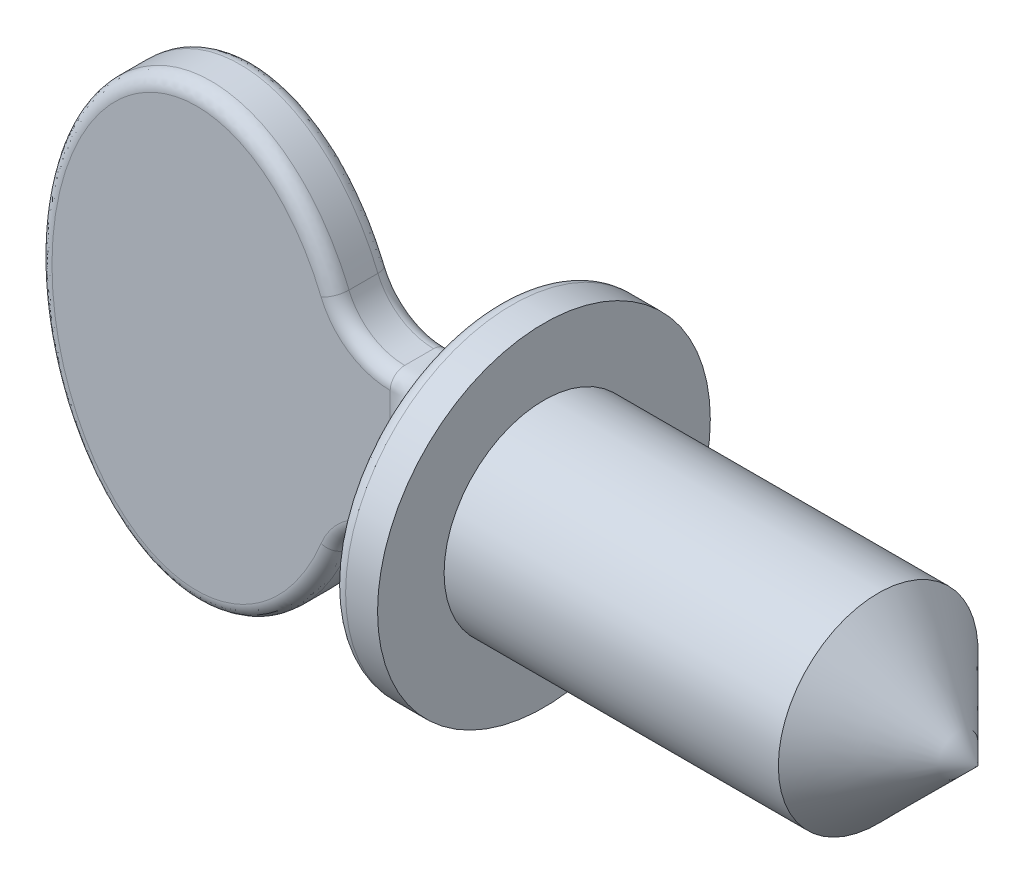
ISO-10303-21;
HEADER;
FILE_DESCRIPTION(('STEP AP214'),'2;1');
FILE_NAME('part.step','',(''),(''),'','','');
FILE_SCHEMA(('AUTOMOTIVE_DESIGN { 1 0 10303 214 1 1 1 1 }'));
ENDSEC;
DATA;
#1=APPLICATION_CONTEXT('core data for automotive mechanical design processes');
#2=APPLICATION_PROTOCOL_DEFINITION('international standard','automotive_design',2000,#1);
#3=PRODUCT_CONTEXT('',#1,'mechanical');
#4=PRODUCT('Part','Part','',(#3));
#5=PRODUCT_RELATED_PRODUCT_CATEGORY('part','',(#4));
#6=PRODUCT_DEFINITION_FORMATION('','',#4);
#7=PRODUCT_DEFINITION_CONTEXT('part definition',#1,'design');
#8=PRODUCT_DEFINITION('design','',#6,#7);
#9=PRODUCT_DEFINITION_SHAPE('','',#8);
#10=(LENGTH_UNIT() NAMED_UNIT(*) SI_UNIT(.MILLI.,.METRE.));
#11=(NAMED_UNIT(*) PLANE_ANGLE_UNIT() SI_UNIT($,.RADIAN.));
#12=(NAMED_UNIT(*) SI_UNIT($,.STERADIAN.) SOLID_ANGLE_UNIT());
#13=UNCERTAINTY_MEASURE_WITH_UNIT(LENGTH_MEASURE(1.E-05),#10,'distance_accuracy_value','');
#14=(GEOMETRIC_REPRESENTATION_CONTEXT(3) GLOBAL_UNCERTAINTY_ASSIGNED_CONTEXT((#13)) GLOBAL_UNIT_ASSIGNED_CONTEXT((#10,
#11,#12)) REPRESENTATION_CONTEXT('',''));
#15=CARTESIAN_POINT('',(0.,0.,0.));
#16=DIRECTION('',(0.,0.,1.));
#17=DIRECTION('',(1.,0.,0.));
#18=AXIS2_PLACEMENT_3D('',#15,#16,#17);
#19=CARTESIAN_POINT('',(3.39763741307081,-2.36920294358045,0.508));
#20=DIRECTION('',(0.,0.,-1.));
#21=DIRECTION('',(-1.,0.,0.));
#22=AXIS2_PLACEMENT_3D('',#19,#20,#21);
#23=CYLINDRICAL_SURFACE('',#22,1.05686961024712);
#24=DIRECTION('',(0.,0.,-1.));
#25=VECTOR('',#24,1.);
#26=CARTESIAN_POINT('',(2.41967497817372,-1.9685,0.508));
#27=LINE('',#26,#25);
#28=CARTESIAN_POINT('',(2.41967497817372,-1.9685,0.254));
#29=VERTEX_POINT('',#28);
#30=CARTESIAN_POINT('',(2.41967497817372,-1.9685,-0.254));
#31=VERTEX_POINT('',#30);
#32=EDGE_CURVE('E606',#29,#31,#27,.T.);
#33=ORIENTED_EDGE('',*,*,#32,.T.);
#34=CARTESIAN_POINT('',(3.39763741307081,-2.36920294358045,-0.254));
#35=DIRECTION('',(0.,0.,1.));
#36=DIRECTION('',(1.,0.,0.));
#37=AXIS2_PLACEMENT_3D('',#34,#35,#36);
#38=CIRCLE('',#37,1.05686961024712);
#39=CARTESIAN_POINT('',(3.39763741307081,-1.31233333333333,-0.254));
#40=VERTEX_POINT('',#39);
#41=EDGE_CURVE('E433',#31,#40,#38,.F.);
#42=ORIENTED_EDGE('',*,*,#41,.T.);
#43=DIRECTION('',(0.,0.,-1.));
#44=VECTOR('',#43,1.);
#45=CARTESIAN_POINT('',(3.39763741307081,-1.31233333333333,0.508));
#46=LINE('',#45,#44);
#47=CARTESIAN_POINT('',(3.39763741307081,-1.31233333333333,0.254));
#48=VERTEX_POINT('',#47);
#49=EDGE_CURVE('E557',#48,#40,#46,.T.);
#50=ORIENTED_EDGE('',*,*,#49,.F.);
#51=CARTESIAN_POINT('',(3.39763741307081,-2.36920294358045,0.254));
#52=DIRECTION('',(0.,0.,1.));
#53=DIRECTION('',(1.,0.,0.));
#54=AXIS2_PLACEMENT_3D('',#51,#52,#53);
#55=CIRCLE('',#54,1.05686961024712);
#56=EDGE_CURVE('E435',#48,#29,#55,.T.);
#57=ORIENTED_EDGE('',*,*,#56,.T.);
#58=EDGE_LOOP('',(#33,#42,#50,#57));
#59=FACE_BOUND('',#58,.T.);
#60=ADVANCED_FACE('F270',(#59),#23,.F.);
#61=CARTESIAN_POINT('',(3.39763741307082,2.36920294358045,0.508));
#62=DIRECTION('',(0.,0.,-1.));
#63=DIRECTION('',(-1.,0.,0.));
#64=AXIS2_PLACEMENT_3D('',#61,#62,#63);
#65=CYLINDRICAL_SURFACE('',#64,1.05686961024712);
#66=DIRECTION('',(0.,0.,-1.));
#67=VECTOR('',#66,1.);
#68=CARTESIAN_POINT('',(3.39763741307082,1.31233333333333,0.508));
#69=LINE('',#68,#67);
#70=CARTESIAN_POINT('',(3.39763741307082,1.31233333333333,0.254));
#71=VERTEX_POINT('',#70);
#72=CARTESIAN_POINT('',(3.39763741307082,1.31233333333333,-0.254));
#73=VERTEX_POINT('',#72);
#74=EDGE_CURVE('E611',#71,#73,#69,.T.);
#75=ORIENTED_EDGE('',*,*,#74,.T.);
#76=CARTESIAN_POINT('',(3.39763741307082,2.36920294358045,-0.254));
#77=DIRECTION('',(0.,0.,1.));
#78=DIRECTION('',(1.,0.,0.));
#79=AXIS2_PLACEMENT_3D('',#76,#77,#78);
#80=CIRCLE('',#79,1.05686961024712);
#81=CARTESIAN_POINT('',(2.41967497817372,1.9685,-0.254));
#82=VERTEX_POINT('',#81);
#83=EDGE_CURVE('E533',#73,#82,#80,.F.);
#84=ORIENTED_EDGE('',*,*,#83,.T.);
#85=DIRECTION('',(0.,0.,-1.));
#86=VECTOR('',#85,1.);
#87=CARTESIAN_POINT('',(2.41967497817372,1.9685,0.508));
#88=LINE('',#87,#86);
#89=CARTESIAN_POINT('',(2.41967497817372,1.9685,0.254));
#90=VERTEX_POINT('',#89);
#91=EDGE_CURVE('E612',#90,#82,#88,.T.);
#92=ORIENTED_EDGE('',*,*,#91,.F.);
#93=CARTESIAN_POINT('',(3.39763741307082,2.36920294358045,0.254));
#94=DIRECTION('',(0.,0.,1.));
#95=DIRECTION('',(1.,0.,0.));
#96=AXIS2_PLACEMENT_3D('',#93,#94,#95);
#97=CIRCLE('',#96,1.05686961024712);
#98=EDGE_CURVE('E538',#90,#71,#97,.T.);
#99=ORIENTED_EDGE('',*,*,#98,.T.);
#100=EDGE_LOOP('',(#75,#84,#92,#99));
#101=FACE_BOUND('',#100,.T.);
#102=ADVANCED_FACE('F357',(#101),#65,.F.);
#103=CARTESIAN_POINT('',(0.,0.,0.508));
#104=DIRECTION('',(0.,0.,1.));
#105=DIRECTION('',(0.,1.,0.));
#106=AXIS2_PLACEMENT_3D('',#103,#104,#105);
#107=ELLIPSE('',#106,3.937,2.794);
#108=DIRECTION('',(0.,0.,-1.));
#109=VECTOR('',#108,1.);
#110=SURFACE_OF_LINEAR_EXTRUSION('',#107,#109);
#111=ORIENTED_EDGE('',*,*,#91,.T.);
#112=CARTESIAN_POINT('',(-2.42953871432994,-1.06988650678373,-0.508));
#113=CARTESIAN_POINT('',(-2.67806308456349,-1.1223425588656,-0.508));
#114=CARTESIAN_POINT('',(-2.67806308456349,-1.1223425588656,-0.254));
#115=CARTESIAN_POINT('',(-2.38132756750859,-1.29830917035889,-0.508));
#116=CARTESIAN_POINT('',(-2.62738331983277,-1.36245895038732,-0.508));
#117=CARTESIAN_POINT('',(-2.62738331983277,-1.36245895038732,-0.254));
#118=CARTESIAN_POINT('',(-2.31706517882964,-1.52335296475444,-0.508));
#119=CARTESIAN_POINT('',(-2.55974244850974,-1.59951584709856,-0.508));
#120=CARTESIAN_POINT('',(-2.55974244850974,-1.59951584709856,-0.254));
#121=CARTESIAN_POINT('',(-2.15402597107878,-1.9606753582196,-0.508));
#122=CARTESIAN_POINT('',(-2.38735395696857,-2.06194694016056,-0.508));
#123=CARTESIAN_POINT('',(-2.38735395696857,-2.06194694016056,-0.254));
#124=CARTESIAN_POINT('',(-2.05530031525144,-2.17297233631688,-0.508));
#125=CARTESIAN_POINT('',(-2.28266133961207,-2.28733788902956,-0.508));
#126=CARTESIAN_POINT('',(-2.28266133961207,-2.28733788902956,-0.254));
#127=CARTESIAN_POINT('',(-1.8565056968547,-2.51319514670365,-0.508));
#128=CARTESIAN_POINT('',(-2.0702557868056,-2.65084271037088,-0.508));
#129=CARTESIAN_POINT('',(-2.0702557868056,-2.65084271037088,-0.254));
#130=CARTESIAN_POINT('',(-1.76631603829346,-2.64689289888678,-0.508));
#131=CARTESIAN_POINT('',(-1.97351333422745,-2.79437306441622,-0.508));
#132=CARTESIAN_POINT('',(-1.97351333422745,-2.79437306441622,-0.254));
#133=CARTESIAN_POINT('',(-1.56670354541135,-2.89917346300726,-0.508));
#134=CARTESIAN_POINT('',(-1.75790917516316,-3.06687436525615,-0.508));
#135=CARTESIAN_POINT('',(-1.75790917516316,-3.06687436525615,-0.254));
#136=CARTESIAN_POINT('',(-1.45730856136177,-3.01777773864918,-0.508));
#137=CARTESIAN_POINT('',(-1.63907948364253,-3.19586595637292,-0.508));
#138=CARTESIAN_POINT('',(-1.63907948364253,-3.19586595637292,-0.254));
#139=CARTESIAN_POINT('',(-1.24726681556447,-3.20759724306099,-0.508));
#140=CARTESIAN_POINT('',(-1.40883959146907,-3.40393298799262,-0.508));
#141=CARTESIAN_POINT('',(-1.40883959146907,-3.40393298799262,-0.254));
#142=CARTESIAN_POINT('',(-1.1507555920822,-3.28336841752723,-0.508));
#143=CARTESIAN_POINT('',(-1.30241841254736,-3.487576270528,-0.508));
#144=CARTESIAN_POINT('',(-1.30241841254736,-3.487576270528,-0.254));
#145=CARTESIAN_POINT('',(-0.946803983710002,-3.41849479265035,-0.508));
#146=CARTESIAN_POINT('',(-1.07576597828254,-3.63774144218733,-0.508));
#147=CARTESIAN_POINT('',(-1.07576597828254,-3.63774144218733,-0.254));
#148=CARTESIAN_POINT('',(-0.839378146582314,-3.47787146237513,-0.508));
#149=CARTESIAN_POINT('',(-0.955553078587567,-3.70428571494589,-0.508));
#150=CARTESIAN_POINT('',(-0.955553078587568,-3.70428571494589,-0.254));
#151=CARTESIAN_POINT('',(-0.633843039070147,-3.56789218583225,-0.508));
#152=CARTESIAN_POINT('',(-0.723818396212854,-3.80577636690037,-0.508));
#153=CARTESIAN_POINT('',(-0.723818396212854,-3.80577636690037,-0.254));
#154=CARTESIAN_POINT('',(-0.537108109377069,-3.60165598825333,-0.508));
#155=CARTESIAN_POINT('',(-0.614119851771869,-3.84411987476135,-0.508));
#156=CARTESIAN_POINT('',(-0.614119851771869,-3.84411987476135,-0.254));
#157=CARTESIAN_POINT('',(-0.339331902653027,-3.65248383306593,-0.508));
#158=CARTESIAN_POINT('',(-0.388801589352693,-3.90202243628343,-0.508));
#159=CARTESIAN_POINT('',(-0.388801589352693,-3.90202243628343,-0.254));
#160=CARTESIAN_POINT('',(-0.238293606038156,-3.66955924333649,-0.508));
#161=CARTESIAN_POINT('',(-0.273185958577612,-3.92159427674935,-0.508));
#162=CARTESIAN_POINT('',(-0.273185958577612,-3.92159427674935,-0.254));
#163=CARTESIAN_POINT('',(-0.0344753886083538,-3.68567445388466,-0.508));
#164=CARTESIAN_POINT('',(-0.0395873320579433,-3.94006182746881,-0.508));
#165=CARTESIAN_POINT('',(-0.0395873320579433,-3.94006182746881,-0.254));
#166=CARTESIAN_POINT('',(0.0683086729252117,-3.68466274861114,-0.508));
#167=CARTESIAN_POINT('',(0.0784014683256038,-3.93889849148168,-0.508));
#168=CARTESIAN_POINT('',(0.0784014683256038,-3.93889849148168,-0.254));
#169=CARTESIAN_POINT('',(0.272088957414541,-3.66456417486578,-0.508));
#170=CARTESIAN_POINT('',(0.311869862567,-3.91587428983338,-0.508));
#171=CARTESIAN_POINT('',(0.311869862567,-3.91587428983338,-0.254));
#172=CARTESIAN_POINT('',(0.373084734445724,-3.64547286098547,-0.508));
#173=CARTESIAN_POINT('',(0.427348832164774,-3.89400833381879,-0.508));
#174=CARTESIAN_POINT('',(0.427348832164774,-3.89400833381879,-0.254));
#175=CARTESIAN_POINT('',(0.566584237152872,-3.5918099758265,-0.508));
#176=CARTESIAN_POINT('',(0.647572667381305,-3.83293861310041,-0.508));
#177=CARTESIAN_POINT('',(0.647572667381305,-3.83293861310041,-0.254));
#178=CARTESIAN_POINT('',(0.659265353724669,-3.5578663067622,-0.508));
#179=CARTESIAN_POINT('',(0.75256001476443,-3.79443882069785,-0.508));
#180=CARTESIAN_POINT('',(0.75256001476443,-3.79443882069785,-0.254));
#181=CARTESIAN_POINT('',(0.838615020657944,-3.47679355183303,-0.508));
#182=CARTESIAN_POINT('',(0.954592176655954,-3.70311336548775,-0.508));
#183=CARTESIAN_POINT('',(0.954592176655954,-3.70311336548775,-0.254));
#184=CARTESIAN_POINT('',(0.925281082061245,-3.42965904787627,-0.508));
#185=CARTESIAN_POINT('',(1.05163370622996,-3.65028181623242,-0.508));
#186=CARTESIAN_POINT('',(1.05163370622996,-3.65028181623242,-0.254));
#187=CARTESIAN_POINT('',(1.12953179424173,-3.30045366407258,-0.508));
#188=CARTESIAN_POINT('',(1.27904250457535,-3.50643406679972,-0.508));
#189=CARTESIAN_POINT('',(1.27904250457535,-3.50643406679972,-0.254));
#190=CARTESIAN_POINT('',(1.24323792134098,-3.21224549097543,-0.508));
#191=CARTESIAN_POINT('',(1.40447787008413,-3.40898221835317,-0.508));
#192=CARTESIAN_POINT('',(1.40447787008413,-3.40898221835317,-0.254));
#193=CARTESIAN_POINT('',(1.45504675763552,-3.01870052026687,-0.508));
#194=CARTESIAN_POINT('',(1.63653892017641,-3.19692872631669,-0.508));
#195=CARTESIAN_POINT('',(1.63653892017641,-3.19692872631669,-0.254));
#196=CARTESIAN_POINT('',(1.55311138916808,-2.91332314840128,-0.508));
#197=CARTESIAN_POINT('',(1.74311876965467,-3.08228651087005,-0.508));
#198=CARTESIAN_POINT('',(1.74311876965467,-3.08228651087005,-0.254));
#199=CARTESIAN_POINT('',(1.75678198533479,-2.66196868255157,-0.508));
#200=CARTESIAN_POINT('',(1.9633248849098,-2.81052824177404,-0.508));
#201=CARTESIAN_POINT('',(1.9633248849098,-2.81052824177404,-0.254));
#202=CARTESIAN_POINT('',(1.85800944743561,-2.51246781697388,-0.508));
#203=CARTESIAN_POINT('',(2.07190130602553,-2.65000792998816,-0.508));
#204=CARTESIAN_POINT('',(2.07190130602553,-2.65000792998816,-0.254));
#205=CARTESIAN_POINT('',(2.03785333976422,-2.20076254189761,-0.508));
#206=CARTESIAN_POINT('',(2.26397611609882,-2.31709468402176,-0.508));
#207=CARTESIAN_POINT('',(2.26397611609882,-2.31709468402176,-0.254));
#208=CARTESIAN_POINT('',(2.11647846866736,-2.03856305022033,-0.508));
#209=CARTESIAN_POINT('',(2.34748415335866,-2.14470634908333,-0.508));
#210=CARTESIAN_POINT('',(2.34748415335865,-2.14470634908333,-0.254));
#211=CARTESIAN_POINT('',(2.22461915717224,-1.7746150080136,-0.508));
#212=CARTESIAN_POINT('',(2.46201925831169,-1.8651443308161,-0.508));
#213=CARTESIAN_POINT('',(2.46201925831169,-1.8651443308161,-0.254));
#214=CARTESIAN_POINT('',(2.2609989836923,-1.67559877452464,-0.508));
#215=CARTESIAN_POINT('',(2.5004698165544,-1.76047506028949,-0.508));
#216=CARTESIAN_POINT('',(2.5004698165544,-1.76047506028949,-0.254));
#217=CARTESIAN_POINT('',(2.32683156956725,-1.47533598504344,-0.508));
#218=CARTESIAN_POINT('',(2.56995291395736,-1.54910644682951,-0.508));
#219=CARTESIAN_POINT('',(2.56995291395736,-1.54910644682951,-0.254));
#220=CARTESIAN_POINT('',(2.35628633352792,-1.37409008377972,-0.508));
#221=CARTESIAN_POINT('',(2.60098759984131,-1.44240770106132,-0.508));
#222=CARTESIAN_POINT('',(2.60098759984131,-1.44240770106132,-0.254));
#223=CARTESIAN_POINT('',(2.45282237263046,-0.99672785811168,-0.508));
#224=CARTESIAN_POINT('',(2.70261039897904,-1.04518135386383,-0.508));
#225=CARTESIAN_POINT('',(2.70261039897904,-1.04518135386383,-0.254));
#226=CARTESIAN_POINT('',(2.49907252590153,-0.715044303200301,-0.508));
#227=CARTESIAN_POINT('',(2.7510952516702,-0.74956565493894,-0.508));
#228=CARTESIAN_POINT('',(2.7510952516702,-0.74956565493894,-0.254));
#229=CARTESIAN_POINT('',(2.54567248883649,-0.147495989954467,-0.508));
#230=CARTESIAN_POINT('',(2.79994937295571,-0.154504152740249,-0.508));
#231=CARTESIAN_POINT('',(2.79994937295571,-0.154504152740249,-0.254));
#232=CARTESIAN_POINT('',(2.54590842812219,0.138377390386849,-0.508));
#233=CARTESIAN_POINT('',(2.80019927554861,0.144949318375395,-0.508));
#234=CARTESIAN_POINT('',(2.80019927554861,0.144949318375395,-0.254));
#235=CARTESIAN_POINT('',(2.50314262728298,0.670744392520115,-0.508));
#236=CARTESIAN_POINT('',(2.75536014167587,0.703113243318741,-0.508));
#237=CARTESIAN_POINT('',(2.75536014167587,0.703113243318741,-0.254));
#238=CARTESIAN_POINT('',(2.46556625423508,0.917675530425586,-0.508));
#239=CARTESIAN_POINT('',(2.71596009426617,0.962218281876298,-0.508));
#240=CARTESIAN_POINT('',(2.71596009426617,0.962218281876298,-0.254));
#241=CARTESIAN_POINT('',(2.35351407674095,1.40317160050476,-0.508));
#242=CARTESIAN_POINT('',(2.5981091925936,1.47286514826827,-0.508));
#243=CARTESIAN_POINT('',(2.5981091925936,1.47286514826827,-0.254));
#244=CARTESIAN_POINT('',(2.27905720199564,1.64174075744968,-0.508));
#245=CARTESIAN_POINT('',(2.51967837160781,1.72441078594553,-0.508));
#246=CARTESIAN_POINT('',(2.51967837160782,1.72441078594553,-0.254));
#247=CARTESIAN_POINT('',(2.10296943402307,2.07153806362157,-0.508));
#248=CARTESIAN_POINT('',(2.33317448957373,2.17963119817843,-0.508));
#249=CARTESIAN_POINT('',(2.33317448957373,2.17963119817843,-0.254));
#250=CARTESIAN_POINT('',(2.00636516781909,2.26480890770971,-0.508));
#251=CARTESIAN_POINT('',(2.23053377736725,2.38518362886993,-0.508));
#252=CARTESIAN_POINT('',(2.23053377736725,2.38518362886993,-0.254));
#253=CARTESIAN_POINT('',(1.78047465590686,2.63124667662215,-0.508));
#254=CARTESIAN_POINT('',(1.98878457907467,2.77737954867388,-0.508));
#255=CARTESIAN_POINT('',(1.98878457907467,2.77737954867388,-0.254));
#256=CARTESIAN_POINT('',(1.65129083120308,2.80447416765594,-0.508));
#257=CARTESIAN_POINT('',(1.84979032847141,2.96407977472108,-0.508));
#258=CARTESIAN_POINT('',(1.84979032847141,2.96407977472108,-0.254));
#259=CARTESIAN_POINT('',(1.41779860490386,3.05444647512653,-0.508));
#260=CARTESIAN_POINT('',(1.59578914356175,3.23598875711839,-0.508));
#261=CARTESIAN_POINT('',(1.59578914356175,3.23598875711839,-0.254));
#262=CARTESIAN_POINT('',(1.32477852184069,3.14175732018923,-0.508));
#263=CARTESIAN_POINT('',(1.49405856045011,3.33156937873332,-0.508));
#264=CARTESIAN_POINT('',(1.49405856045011,3.33156937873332,-0.254));
#265=CARTESIAN_POINT('',(1.1264653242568,3.3011914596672,-0.508));
#266=CARTESIAN_POINT('',(1.27551873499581,3.50726804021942,-0.508));
#267=CARTESIAN_POINT('',(1.27551873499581,3.50726804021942,-0.254));
#268=CARTESIAN_POINT('',(1.02118853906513,3.37333460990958,-0.508));
#269=CARTESIAN_POINT('',(1.15872953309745,3.58740628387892,-0.508));
#270=CARTESIAN_POINT('',(1.15872953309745,3.58740628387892,-0.254));
#271=CARTESIAN_POINT('',(0.817330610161,3.48785914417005,-0.508));
#272=CARTESIAN_POINT('',(0.930720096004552,3.7154934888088,-0.508));
#273=CARTESIAN_POINT('',(0.930720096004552,3.7154934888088,-0.254));
#274=CARTESIAN_POINT('',(0.720402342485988,3.53316262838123,-0.508));
#275=CARTESIAN_POINT('',(0.821632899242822,3.76654812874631,-0.508));
#276=CARTESIAN_POINT('',(0.821632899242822,3.76654812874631,-0.254));
#277=CARTESIAN_POINT('',(0.520328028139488,3.60703504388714,-0.508));
#278=CARTESIAN_POINT('',(0.595089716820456,3.85018992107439,-0.508));
#279=CARTESIAN_POINT('',(0.595089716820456,3.85018992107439,-0.254));
#280=CARTESIAN_POINT('',(0.417186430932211,3.63561579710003,-0.508));
#281=CARTESIAN_POINT('',(0.477639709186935,3.88279011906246,-0.508));
#282=CARTESIAN_POINT('',(0.477639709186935,3.88279011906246,-0.254));
#283=CARTESIAN_POINT('',(0.206818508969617,3.67387815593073,-0.508));
#284=CARTESIAN_POINT('',(0.237206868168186,3.92651558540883,-0.508));
#285=CARTESIAN_POINT('',(0.237206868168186,3.92651558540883,-0.254));
#286=CARTESIAN_POINT('',(0.0995732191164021,3.68345742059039,-0.508));
#287=CARTESIAN_POINT('',(0.114197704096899,3.9375245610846,-0.508));
#288=CARTESIAN_POINT('',(0.114197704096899,3.9375245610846,-0.254));
#289=CARTESIAN_POINT('',(-0.114821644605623,3.68250895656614,-0.508));
#290=CARTESIAN_POINT('',(-0.131686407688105,3.93643687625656,-0.508));
#291=CARTESIAN_POINT('',(-0.131686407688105,3.93643687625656,-0.254));
#292=CARTESIAN_POINT('',(-0.221971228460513,3.67198365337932,-0.508));
#293=CARTESIAN_POINT('',(-0.254561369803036,3.92434300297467,-0.508));
#294=CARTESIAN_POINT('',(-0.254561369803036,3.92434300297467,-0.254));
#295=CARTESIAN_POINT('',(-0.423404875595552,3.6335702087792,-0.508));
#296=CARTESIAN_POINT('',(-0.484708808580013,3.88045959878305,-0.508));
#297=CARTESIAN_POINT('',(-0.484708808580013,3.88045959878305,-0.254));
#298=CARTESIAN_POINT('',(-0.517999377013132,3.60726509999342,-0.508));
#299=CARTESIAN_POINT('',(-0.592410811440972,3.85046695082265,-0.508));
#300=CARTESIAN_POINT('',(-0.592410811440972,3.85046695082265,-0.254));
#301=CARTESIAN_POINT('',(-0.702018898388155,3.54051420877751,-0.508));
#302=CARTESIAN_POINT('',(-0.80085538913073,3.77485728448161,-0.508));
#303=CARTESIAN_POINT('',(-0.800855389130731,3.77485728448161,-0.254));
#304=CARTESIAN_POINT('',(-0.791441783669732,3.5000626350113,-0.508));
#305=CARTESIAN_POINT('',(-0.901595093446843,3.72923386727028,-0.508));
#306=CARTESIAN_POINT('',(-0.901595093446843,3.72923386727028,-0.254));
#307=CARTESIAN_POINT('',(-0.995772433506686,3.38993421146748,-0.508));
#308=CARTESIAN_POINT('',(-1.13047031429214,3.60588286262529,-0.508));
#309=CARTESIAN_POINT('',(-1.13047031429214,3.60588286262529,-0.254));
#310=CARTESIAN_POINT('',(-1.10783636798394,3.31498239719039,-0.508));
#311=CARTESIAN_POINT('',(-1.25491481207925,3.52252387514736,-0.508));
#312=CARTESIAN_POINT('',(-1.25491481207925,3.52252387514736,-0.254));
#313=CARTESIAN_POINT('',(-1.31837395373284,3.14796333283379,-0.508));
#314=CARTESIAN_POINT('',(-1.48706802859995,3.33835616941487,-0.508));
#315=CARTESIAN_POINT('',(-1.48706802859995,3.33835616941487,-0.254));
#316=CARTESIAN_POINT('',(-1.41681992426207,3.05586208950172,-0.508));
#317=CARTESIAN_POINT('',(-1.59474271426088,3.23751282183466,-0.508));
#318=CARTESIAN_POINT('',(-1.59474271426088,3.23751282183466,-0.254));
#319=CARTESIAN_POINT('',(-1.63609804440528,2.82020806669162,-0.508));
#320=CARTESIAN_POINT('',(-1.83323646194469,2.98121697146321,-0.508));
#321=CARTESIAN_POINT('',(-1.83323646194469,2.98121697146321,-0.254));
#322=CARTESIAN_POINT('',(-1.75048386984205,2.67067473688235,-0.508));
#323=CARTESIAN_POINT('',(-1.95647717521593,2.81989583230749,-0.508));
#324=CARTESIAN_POINT('',(-1.95647717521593,2.81989583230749,-0.254));
#325=CARTESIAN_POINT('',(-1.95420988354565,2.35553788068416,-0.508));
#326=CARTESIAN_POINT('',(-2.1748556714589,2.48207587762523,-0.508));
#327=CARTESIAN_POINT('',(-2.1748556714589,2.48207587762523,-0.254));
#328=CARTESIAN_POINT('',(-2.04350621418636,2.18990688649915,-0.508));
#329=CARTESIAN_POINT('',(-2.2699442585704,2.30555118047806,-0.508));
#330=CARTESIAN_POINT('',(-2.2699442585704,2.30555118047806,-0.254));
#331=CARTESIAN_POINT('',(-2.22882804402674,1.78241164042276,-0.508));
#332=CARTESIAN_POINT('',(-2.46665332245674,1.87302961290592,-0.508));
#333=CARTESIAN_POINT('',(-2.46665332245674,1.87302961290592,-0.254));
#334=CARTESIAN_POINT('',(-2.3142397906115,1.53572223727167,-0.508));
#335=CARTESIAN_POINT('',(-2.55672789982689,1.61257271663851,-0.508));
#336=CARTESIAN_POINT('',(-2.55672789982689,1.61257271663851,-0.254));
#337=CARTESIAN_POINT('',(-2.44446639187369,1.03199799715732,-0.508));
#338=CARTESIAN_POINT('',(-2.69381177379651,1.08228449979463,-0.508));
#339=CARTESIAN_POINT('',(-2.69381177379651,1.08228449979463,-0.254));
#340=CARTESIAN_POINT('',(-2.48924065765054,0.774953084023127,-0.508));
#341=CARTESIAN_POINT('',(-2.74077801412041,0.812444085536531,-0.508));
#342=CARTESIAN_POINT('',(-2.74077801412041,0.812444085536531,-0.254));
#343=CARTESIAN_POINT('',(-2.54075598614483,0.251563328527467,-0.508));
#344=CARTESIAN_POINT('',(-2.79480168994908,0.263568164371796,-0.508));
#345=CARTESIAN_POINT('',(-2.79480168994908,0.263568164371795,-0.254));
#346=CARTESIAN_POINT('',(-2.54666205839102,-0.0148627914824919,-0.508));
#347=CARTESIAN_POINT('',(-2.80098296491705,-0.015540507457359,-0.508));
#348=CARTESIAN_POINT('',(-2.80098296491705,-0.0155405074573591,-0.254));
#349=CARTESIAN_POINT('',(-2.51848120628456,-0.545613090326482,-0.508));
#350=CARTESIAN_POINT('',(-2.77144588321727,-0.571867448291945,-0.508));
#351=CARTESIAN_POINT('',(-2.77144588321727,-0.571867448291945,-0.254));
#352=CARTESIAN_POINT('',(-2.48440379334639,-0.809937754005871,-0.508));
#353=CARTESIAN_POINT('',(-2.73573749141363,-0.849086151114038,-0.508));
#354=CARTESIAN_POINT('',(-2.73573749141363,-0.849086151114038,-0.254));
#355=CARTESIAN_POINT('',(-2.42953871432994,-1.06988650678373,-0.508));
#356=CARTESIAN_POINT('',(-2.67806308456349,-1.1223425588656,-0.508));
#357=CARTESIAN_POINT('',(-2.67806308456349,-1.1223425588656,-0.254));
#358=(BOUNDED_SURFACE() B_SPLINE_SURFACE(3,2,((#112,#113,#114),(#115,#116,#117),(#118,#119,
#120),(#121,#122,#123),(#124,#125,#126),(#127,#128,#129),(#130,#131,#132),(#133,#134,#135),
(#136,#137,#138),(#139,#140,#141),(#142,#143,#144),(#145,#146,#147),(#148,#149,#150),(#151,#152,
#153),(#154,#155,#156),(#157,#158,#159),(#160,#161,#162),(#163,#164,#165),(#166,#167,#168),
(#169,#170,#171),(#172,#173,#174),(#175,#176,#177),(#178,#179,#180),(#181,#182,#183),(#184,#185,
#186),(#187,#188,#189),(#190,#191,#192),(#193,#194,#195),(#196,#197,#198),(#199,#200,#201),
(#202,#203,#204),(#205,#206,#207),(#208,#209,#210),(#211,#212,#213),(#214,#215,#216),(#217,#218,
#219),(#220,#221,#222),(#223,#224,#225),(#226,#227,#228),(#229,#230,#231),(#232,#233,#234),
(#235,#236,#237),(#238,#239,#240),(#241,#242,#243),(#244,#245,#246),(#247,#248,#249),(#250,#251,
#252),(#253,#254,#255),(#256,#257,#258),(#259,#260,#261),(#262,#263,#264),(#265,#266,#267),
(#268,#269,#270),(#271,#272,#273),(#274,#275,#276),(#277,#278,#279),(#280,#281,#282),(#283,#284,
#285),(#286,#287,#288),(#289,#290,#291),(#292,#293,#294),(#295,#296,#297),(#298,#299,#300),
(#301,#302,#303),(#304,#305,#306),(#307,#308,#309),(#310,#311,#312),(#313,#314,#315),(#316,#317,
#318),(#319,#320,#321),(#322,#323,#324),(#325,#326,#327),(#328,#329,#330),(#331,#332,#333),
(#334,#335,#336),(#337,#338,#339),(#340,#341,#342),(#343,#344,#345),(#346,#347,#348),(#349,#350,
#351),(#352,#353,#354),(#355,#356,#357)),.UNSPECIFIED.,.T.,.F.,
.F.) B_SPLINE_SURFACE_WITH_KNOTS((4,2,2,2,2,2,2,2,2,2,2,2,2,2,2,2,2,2,2,2,2,2,2,2,2,2,2,2,2,2,2,
2,2,2,2,2,2,2,2,2,4),(3,3),(0.,0.699735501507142,1.39843658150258,1.88081590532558,
2.36250140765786,2.7293120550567,3.09564005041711,3.401707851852,3.7075670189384,
4.01429730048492,4.32110302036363,4.61603131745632,4.91108093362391,5.34040544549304,
5.77075965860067,6.31008999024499,6.84921247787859,7.16544039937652,7.48157666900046,
8.33348152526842,9.18749454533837,9.93427445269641,10.6806714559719,11.3262865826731,
11.9698968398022,12.3514499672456,12.7325004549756,13.052173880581,13.371621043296,
13.6927841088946,14.0139084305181,14.3072154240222,14.6006426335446,15.0028628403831,
15.405888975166,15.9675913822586,16.530269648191,17.3092934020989,18.0890943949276,
18.8855943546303,19.6819048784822),(0.,1.),
.UNSPECIFIED.) GEOMETRIC_REPRESENTATION_ITEM() RATIONAL_B_SPLINE_SURFACE(((1.,0.707106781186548,
1.),(1.,0.707106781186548,1.),(1.,0.707106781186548,1.),(1.,0.707106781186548,1.),(1.,
0.707106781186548,1.),(1.,0.707106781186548,1.),(1.,0.707106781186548,1.),(1.,0.707106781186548,
1.),(1.,0.707106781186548,1.),(1.,0.707106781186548,1.),(1.,0.707106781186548,1.),(1.,
0.707106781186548,1.),(1.,0.707106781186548,1.),(1.,0.707106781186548,1.),(1.,0.707106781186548,
1.),(1.,0.707106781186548,1.),(1.,0.707106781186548,1.),(1.,0.707106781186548,1.),(1.,
0.707106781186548,1.),(1.,0.707106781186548,1.),(1.,0.707106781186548,1.),(1.,0.707106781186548,
1.),(1.,0.707106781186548,1.),(1.,0.707106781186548,1.),(1.,0.707106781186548,1.),(1.,
0.707106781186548,1.),(1.,0.707106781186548,1.),(1.,0.707106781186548,1.),(1.,0.707106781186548,
1.),(1.,0.707106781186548,1.),(1.,0.707106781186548,1.),(1.,0.707106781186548,1.),(1.,
0.707106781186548,1.),(1.,0.707106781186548,1.),(1.,0.707106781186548,1.),(1.,0.707106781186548,
1.),(1.,0.707106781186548,1.),(1.,0.707106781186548,1.),(1.,0.707106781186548,1.),(1.,
0.707106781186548,1.),(1.,0.707106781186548,1.),(1.,0.707106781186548,1.),(1.,0.707106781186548,
1.),(1.,0.707106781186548,1.),(1.,0.707106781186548,1.),(1.,0.707106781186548,1.),(1.,
0.707106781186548,1.),(1.,0.707106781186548,1.),(1.,0.707106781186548,1.),(1.,0.707106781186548,
1.),(1.,0.707106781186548,1.),(1.,0.707106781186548,1.),(1.,0.707106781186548,1.),(1.,
0.707106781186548,1.),(1.,0.707106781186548,1.),(1.,0.707106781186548,1.),(1.,0.707106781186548,
1.),(1.,0.707106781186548,1.),(1.,0.707106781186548,1.),(1.,0.707106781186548,1.),(1.,
0.707106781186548,1.),(1.,0.707106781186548,1.),(1.,0.707106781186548,1.),(1.,0.707106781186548,
1.),(1.,0.707106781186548,1.),(1.,0.707106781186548,1.),(1.,0.707106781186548,1.),(1.,
0.707106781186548,1.),(1.,0.707106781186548,1.),(1.,0.707106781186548,1.),(1.,0.707106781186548,
1.),(1.,0.707106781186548,1.),(1.,0.707106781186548,1.),(1.,0.707106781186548,1.),(1.,
0.707106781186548,1.),(1.,0.707106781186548,1.),(1.,0.707106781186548,1.),(1.,0.707106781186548,
1.),(1.,0.707106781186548,1.),(1.,0.707106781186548,1.),(1.,0.707106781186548,1.),(1.,
0.707106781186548,1.))) REPRESENTATION_ITEM('') SURFACE());
#359=CARTESIAN_POINT('',(2.41967497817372,1.9685,-0.254));
#360=CARTESIAN_POINT('',(2.25031042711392,2.38542945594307,-0.254));
#361=CARTESIAN_POINT('',(2.00596675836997,2.79648158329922,-0.254));
#362=CARTESIAN_POINT('',(1.49799160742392,3.34093166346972,-0.254));
#363=CARTESIAN_POINT('',(1.27918524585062,3.52006526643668,-0.254));
#364=CARTESIAN_POINT('',(0.824519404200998,3.77487228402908,-0.254));
#365=CARTESIAN_POINT('',(0.5953372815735,3.86152000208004,-0.254));
#366=CARTESIAN_POINT('',(0.11627433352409,3.94837182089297,-0.254));
#367=CARTESIAN_POINT('',(-0.133883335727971,3.94714153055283,-0.254));
#368=CARTESIAN_POINT('',(-0.592713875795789,3.86005719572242,-0.254));
#369=CARTESIAN_POINT('',(-0.803064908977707,3.78232434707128,-0.254));
#370=CARTESIAN_POINT('',(-1.25884339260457,3.53671269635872,-0.254));
#371=CARTESIAN_POINT('',(-1.49225794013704,3.34730250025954,-0.254));
#372=CARTESIAN_POINT('',(-1.9688886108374,2.83590773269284,-0.254));
#373=CARTESIAN_POINT('',(-2.18567037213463,2.49073765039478,-0.254));
#374=CARTESIAN_POINT('',(-2.57946081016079,1.62514496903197,-0.254));
#375=CARTESIAN_POINT('',(-2.71380281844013,1.08646076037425,-0.254));
#376=CARTESIAN_POINT('',(-2.82215303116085,-0.0142692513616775,-0.254));
#377=CARTESIAN_POINT('',(-2.79328752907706,-0.576559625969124,-0.254));
#378=CARTESIAN_POINT('',(-2.5760189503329,-1.60569439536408,-0.254));
#379=CARTESIAN_POINT('',(-2.40624277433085,-2.07609930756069,-0.254));
#380=CARTESIAN_POINT('',(-1.98146625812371,-2.80261486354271,-0.254));
#381=CARTESIAN_POINT('',(-1.76650882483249,-3.08096180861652,-0.254));
#382=CARTESIAN_POINT('',(-1.30657381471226,-3.49615219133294,-0.254));
#383=CARTESIAN_POINT('',(-1.07838575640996,-3.65062001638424,-0.254));
#384=CARTESIAN_POINT('',(-0.616409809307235,-3.85270583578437,-0.254));
#385=CARTESIAN_POINT('',(-0.388253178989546,-3.91258803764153,-0.254));
#386=CARTESIAN_POINT('',(0.0769150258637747,-3.94918083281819,-0.254));
#387=CARTESIAN_POINT('',(0.313980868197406,-3.92525354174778,-0.254));
#388=CARTESIAN_POINT('',(0.753403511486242,-3.80377336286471,-0.254));
#389=CARTESIAN_POINT('',(0.956930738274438,-3.71016433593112,-0.254));
#390=CARTESIAN_POINT('',(1.40977740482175,-3.42376866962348,-0.254));
#391=CARTESIAN_POINT('',(1.6427552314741,-3.20589476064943,-0.254));
#392=CARTESIAN_POINT('',(2.03111441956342,-2.72710992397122,-0.254));
#393=CARTESIAN_POINT('',(2.18919790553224,-2.46823947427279,-0.254));
#394=CARTESIAN_POINT('',(2.35453247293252,-2.12142025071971,-0.254));
#395=CARTESIAN_POINT('',(2.38815642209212,-2.04532960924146,-0.254));
#396=CARTESIAN_POINT('',(2.41967497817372,-1.9685,-0.254));
#397=B_SPLINE_CURVE_WITH_KNOTS('',3,(#359,#360,#361,#362,#363,#364,#365,#366,#367,#368,#369,
#370,#371,#372,#373,#374,#375,#376,#377,#378,#379,#380,#381,#382,#383,#384,#385,#386,#387,#388,
#389,#390,#391,#392,#393,#394,#395,#396),.UNSPECIFIED.,.F.,.F.,(4,2,2,2,2,2,2,2,2,2,2,2,2,2,2,2,
2,2,4),(0.,1.37556453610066,2.21375379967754,2.93458248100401,3.66717955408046,4.32956836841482,
5.21483606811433,6.41718702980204,8.05393798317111,9.71959706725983,11.1947245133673,
12.2336794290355,13.0458946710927,13.740094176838,14.4395887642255,15.1022444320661,
16.0414723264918,16.9435917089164,17.1929672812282),.UNSPECIFIED.);
#398=EDGE_CURVE('E566',#82,#31,#397,.T.);
#399=ORIENTED_EDGE('',*,*,#398,.T.);
#400=ORIENTED_EDGE('',*,*,#32,.F.);
#401=CARTESIAN_POINT('',(-2.42953871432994,1.06988650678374,0.508));
#402=CARTESIAN_POINT('',(-2.67806308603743,1.12234255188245,0.508));
#403=CARTESIAN_POINT('',(-2.67806308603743,1.12234255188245,0.254));
#404=CARTESIAN_POINT('',(-2.38132756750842,1.29830917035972,0.508));
#405=CARTESIAN_POINT('',(-2.62738332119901,1.36245894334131,0.508));
#406=CARTESIAN_POINT('',(-2.62738332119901,1.36245894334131,0.254));
#407=CARTESIAN_POINT('',(-2.31706517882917,1.52335296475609,0.508));
#408=CARTESIAN_POINT('',(-2.55974244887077,1.59951584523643,0.508));
#409=CARTESIAN_POINT('',(-2.55974244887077,1.59951584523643,0.254));
#410=CARTESIAN_POINT('',(-2.15402597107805,1.96067535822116,0.508));
#411=CARTESIAN_POINT('',(-2.38735395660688,2.06194694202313,0.508));
#412=CARTESIAN_POINT('',(-2.38735395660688,2.06194694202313,0.254));
#413=CARTESIAN_POINT('',(-2.05530031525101,2.17297233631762,0.508));
#414=CARTESIAN_POINT('',(-2.28266133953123,2.28733788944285,0.508));
#415=CARTESIAN_POINT('',(-2.28266133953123,2.28733788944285,0.254));
#416=CARTESIAN_POINT('',(-1.8565056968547,2.51319514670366,0.508));
#417=CARTESIAN_POINT('',(-2.07025578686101,2.65084271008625,0.508));
#418=CARTESIAN_POINT('',(-2.07025578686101,2.65084271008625,0.254));
#419=CARTESIAN_POINT('',(-1.76631603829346,2.64689289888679,0.508));
#420=CARTESIAN_POINT('',(-1.97351333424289,2.79437306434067,0.508));
#421=CARTESIAN_POINT('',(-1.97351333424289,2.79437306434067,0.254));
#422=CARTESIAN_POINT('',(-1.56670354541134,2.89917346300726,0.508));
#423=CARTESIAN_POINT('',(-1.75790917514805,3.06687436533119,0.508));
#424=CARTESIAN_POINT('',(-1.75790917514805,3.06687436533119,0.254));
#425=CARTESIAN_POINT('',(-1.45730856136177,3.01777773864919,0.508));
#426=CARTESIAN_POINT('',(-1.63907948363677,3.19586595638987,0.508));
#427=CARTESIAN_POINT('',(-1.63907948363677,3.19586595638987,0.254));
#428=CARTESIAN_POINT('',(-1.24726681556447,3.20759724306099,0.508));
#429=CARTESIAN_POINT('',(-1.40883959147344,3.40393298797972,0.508));
#430=CARTESIAN_POINT('',(-1.40883959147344,3.40393298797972,0.254));
#431=CARTESIAN_POINT('',(-1.1507555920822,3.28336841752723,0.508));
#432=CARTESIAN_POINT('',(-1.30241841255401,3.48757627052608,0.508));
#433=CARTESIAN_POINT('',(-1.30241841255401,3.48757627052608,0.254));
#434=CARTESIAN_POINT('',(-0.946803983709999,3.41849479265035,0.508));
#435=CARTESIAN_POINT('',(-1.07576597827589,3.63774144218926,0.508));
#436=CARTESIAN_POINT('',(-1.07576597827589,3.63774144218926,0.254));
#437=CARTESIAN_POINT('',(-0.839378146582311,3.47787146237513,0.508));
#438=CARTESIAN_POINT('',(-0.955553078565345,3.70428571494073,0.508));
#439=CARTESIAN_POINT('',(-0.955553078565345,3.70428571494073,0.254));
#440=CARTESIAN_POINT('',(-0.633843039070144,3.56789218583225,0.508));
#441=CARTESIAN_POINT('',(-0.723818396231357,3.80577636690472,0.508));
#442=CARTESIAN_POINT('',(-0.723818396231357,3.80577636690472,0.254));
#443=CARTESIAN_POINT('',(-0.537108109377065,3.60165598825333,0.508));
#444=CARTESIAN_POINT('',(-0.614119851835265,3.84411987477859,0.508));
#445=CARTESIAN_POINT('',(-0.614119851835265,3.84411987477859,0.254));
#446=CARTESIAN_POINT('',(-0.339331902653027,3.65248383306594,0.508));
#447=CARTESIAN_POINT('',(-0.388801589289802,3.90202243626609,0.508));
#448=CARTESIAN_POINT('',(-0.388801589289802,3.90202243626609,0.254));
#449=CARTESIAN_POINT('',(-0.238293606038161,3.6695592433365,0.508));
#450=CARTESIAN_POINT('',(-0.273185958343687,3.92159427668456,0.508));
#451=CARTESIAN_POINT('',(-0.273185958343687,3.92159427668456,0.254));
#452=CARTESIAN_POINT('',(-0.0344753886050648,3.68567445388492,0.508));
#453=CARTESIAN_POINT('',(-0.0395873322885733,3.94006182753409,0.508));
#454=CARTESIAN_POINT('',(-0.0395873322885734,3.94006182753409,0.254));
#455=CARTESIAN_POINT('',(0.0683086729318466,3.68466274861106,0.508));
#456=CARTESIAN_POINT('',(0.0784014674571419,3.93889849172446,0.508));
#457=CARTESIAN_POINT('',(0.0784014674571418,3.93889849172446,0.254));
#458=CARTESIAN_POINT('',(0.272088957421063,3.66456417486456,0.508));
#459=CARTESIAN_POINT('',(0.311869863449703,3.91587428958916,0.508));
#460=CARTESIAN_POINT('',(0.311869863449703,3.91587428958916,0.254));
#461=CARTESIAN_POINT('',(0.373084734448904,3.64547286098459,0.508));
#462=CARTESIAN_POINT('',(0.427348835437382,3.89400833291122,0.508));
#463=CARTESIAN_POINT('',(0.427348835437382,3.89400833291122,0.254));
#464=CARTESIAN_POINT('',(0.566584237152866,3.5918099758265,0.508));
#465=CARTESIAN_POINT('',(0.647572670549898,3.83293861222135,0.508));
#466=CARTESIAN_POINT('',(0.647572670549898,3.83293861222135,0.254));
#467=CARTESIAN_POINT('',(0.659265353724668,3.5578663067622,0.508));
#468=CARTESIAN_POINT('',(0.752560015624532,3.79443882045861,0.508));
#469=CARTESIAN_POINT('',(0.752560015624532,3.79443882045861,0.254));
#470=CARTESIAN_POINT('',(0.838615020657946,3.47679355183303,0.508));
#471=CARTESIAN_POINT('',(0.954592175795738,3.70311336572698,0.508));
#472=CARTESIAN_POINT('',(0.954592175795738,3.70311336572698,0.254));
#473=CARTESIAN_POINT('',(0.925281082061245,3.42965904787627,0.508));
#474=CARTESIAN_POINT('',(1.05163370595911,3.65028181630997,0.508));
#475=CARTESIAN_POINT('',(1.05163370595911,3.65028181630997,0.254));
#476=CARTESIAN_POINT('',(1.12953179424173,3.30045366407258,0.508));
#477=CARTESIAN_POINT('',(1.2790425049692,3.50643406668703,0.508));
#478=CARTESIAN_POINT('',(1.2790425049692,3.50643406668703,0.254));
#479=CARTESIAN_POINT('',(1.24323792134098,3.21224549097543,0.508));
#480=CARTESIAN_POINT('',(1.40447787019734,3.40898221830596,0.508));
#481=CARTESIAN_POINT('',(1.40447787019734,3.40898221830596,0.254));
#482=CARTESIAN_POINT('',(1.45504675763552,3.01870052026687,0.508));
#483=CARTESIAN_POINT('',(1.63653892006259,3.19692872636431,0.508));
#484=CARTESIAN_POINT('',(1.63653892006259,3.19692872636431,0.254));
#485=CARTESIAN_POINT('',(1.55311138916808,2.91332314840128,0.508));
#486=CARTESIAN_POINT('',(1.74311876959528,3.08228651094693,0.508));
#487=CARTESIAN_POINT('',(1.74311876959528,3.08228651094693,0.254));
#488=CARTESIAN_POINT('',(1.75678198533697,2.66196868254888,0.508));
#489=CARTESIAN_POINT('',(1.96332488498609,2.8105282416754,0.508));
#490=CARTESIAN_POINT('',(1.96332488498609,2.8105282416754,0.254));
#491=CARTESIAN_POINT('',(1.85800944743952,2.51246781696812,0.508));
#492=CARTESIAN_POINT('',(2.07190130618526,2.65000792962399,0.508));
#493=CARTESIAN_POINT('',(2.07190130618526,2.65000792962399,0.254));
#494=CARTESIAN_POINT('',(2.03785333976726,2.20076254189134,0.508));
#495=CARTESIAN_POINT('',(2.26397611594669,2.31709468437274,0.508));
#496=CARTESIAN_POINT('',(2.26397611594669,2.31709468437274,0.254));
#497=CARTESIAN_POINT('',(2.11647846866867,2.03856305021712,0.508));
#498=CARTESIAN_POINT('',(2.34748415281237,2.14470635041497,0.508));
#499=CARTESIAN_POINT('',(2.34748415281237,2.14470635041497,0.254));
#500=CARTESIAN_POINT('',(2.22461915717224,1.7746150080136,0.508));
#501=CARTESIAN_POINT('',(2.4620192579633,1.86514433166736,0.508));
#502=CARTESIAN_POINT('',(2.4620192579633,1.86514433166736,0.254));
#503=CARTESIAN_POINT('',(2.2609989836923,1.67559877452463,0.508));
#504=CARTESIAN_POINT('',(2.50046981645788,1.7604750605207,0.508));
#505=CARTESIAN_POINT('',(2.50046981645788,1.7604750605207,0.254));
#506=CARTESIAN_POINT('',(2.32683156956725,1.47533598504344,0.508));
#507=CARTESIAN_POINT('',(2.56995291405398,1.54910644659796,0.508));
#508=CARTESIAN_POINT('',(2.56995291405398,1.54910644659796,0.254));
#509=CARTESIAN_POINT('',(2.35628633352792,1.37409008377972,0.508));
#510=CARTESIAN_POINT('',(2.6009875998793,1.44240770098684,0.508));
#511=CARTESIAN_POINT('',(2.6009875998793,1.44240770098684,0.254));
#512=CARTESIAN_POINT('',(2.45282237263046,0.996727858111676,0.508));
#513=CARTESIAN_POINT('',(2.7026103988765,1.04518135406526,0.508));
#514=CARTESIAN_POINT('',(2.7026103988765,1.04518135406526,0.254));
#515=CARTESIAN_POINT('',(2.49907252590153,0.715044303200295,0.508));
#516=CARTESIAN_POINT('',(2.75109525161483,0.749565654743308,0.508));
#517=CARTESIAN_POINT('',(2.75109525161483,0.749565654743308,0.254));
#518=CARTESIAN_POINT('',(2.54567248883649,0.147495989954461,0.508));
#519=CARTESIAN_POINT('',(2.79994937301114,0.154504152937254,0.508));
#520=CARTESIAN_POINT('',(2.79994937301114,0.154504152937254,0.254));
#521=CARTESIAN_POINT('',(2.54590842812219,-0.138377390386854,0.508));
#522=CARTESIAN_POINT('',(2.80019927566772,-0.144949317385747,0.508));
#523=CARTESIAN_POINT('',(2.80019927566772,-0.144949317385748,0.254));
#524=CARTESIAN_POINT('',(2.50314262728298,-0.67074439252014,0.508));
#525=CARTESIAN_POINT('',(2.75536014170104,-0.703113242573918,0.508));
#526=CARTESIAN_POINT('',(2.75536014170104,-0.703113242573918,0.254));
#527=CARTESIAN_POINT('',(2.46556625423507,-0.917675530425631,0.508));
#528=CARTESIAN_POINT('',(2.71596009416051,-0.962218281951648,0.508));
#529=CARTESIAN_POINT('',(2.7159600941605,-0.962218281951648,0.254));
#530=CARTESIAN_POINT('',(2.35351407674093,-1.4031716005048,0.508));
#531=CARTESIAN_POINT('',(2.59810919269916,-1.47286514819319,0.508));
#532=CARTESIAN_POINT('',(2.59810919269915,-1.47286514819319,0.254));
#533=CARTESIAN_POINT('',(2.27905720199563,-1.6417407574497,0.508));
#534=CARTESIAN_POINT('',(2.51967837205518,-1.72441078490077,0.508));
#535=CARTESIAN_POINT('',(2.51967837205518,-1.72441078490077,0.254));
#536=CARTESIAN_POINT('',(2.10296943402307,-2.07153806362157,0.508));
#537=CARTESIAN_POINT('',(2.33317448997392,-2.17963119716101,0.508));
#538=CARTESIAN_POINT('',(2.33317448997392,-2.17963119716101,0.254));
#539=CARTESIAN_POINT('',(2.00636516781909,-2.26480890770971,0.508));
#540=CARTESIAN_POINT('',(2.2305337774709,-2.38518362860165,0.508));
#541=CARTESIAN_POINT('',(2.2305337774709,-2.38518362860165,0.254));
#542=CARTESIAN_POINT('',(1.78047465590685,-2.63124667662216,0.508));
#543=CARTESIAN_POINT('',(1.98878457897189,-2.77737954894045,0.508));
#544=CARTESIAN_POINT('',(1.98878457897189,-2.77737954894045,0.254));
#545=CARTESIAN_POINT('',(1.65129083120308,-2.80447416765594,0.508));
#546=CARTESIAN_POINT('',(1.84979032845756,-2.96407977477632,0.508));
#547=CARTESIAN_POINT('',(1.84979032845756,-2.96407977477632,0.254));
#548=CARTESIAN_POINT('',(1.41779860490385,-3.05444647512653,0.508));
#549=CARTESIAN_POINT('',(1.59578914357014,-3.23598875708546,0.508));
#550=CARTESIAN_POINT('',(1.59578914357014,-3.23598875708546,0.254));
#551=CARTESIAN_POINT('',(1.32477852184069,-3.14175732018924,0.508));
#552=CARTESIAN_POINT('',(1.49405856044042,-3.33156937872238,0.508));
#553=CARTESIAN_POINT('',(1.49405856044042,-3.33156937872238,0.254));
#554=CARTESIAN_POINT('',(1.1264653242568,-3.30119145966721,0.508));
#555=CARTESIAN_POINT('',(1.27551873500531,-3.50726804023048,0.508));
#556=CARTESIAN_POINT('',(1.27551873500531,-3.50726804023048,0.254));
#557=CARTESIAN_POINT('',(1.02118853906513,-3.37333460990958,0.508));
#558=CARTESIAN_POINT('',(1.15872953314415,-3.58740628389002,0.508));
#559=CARTESIAN_POINT('',(1.15872953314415,-3.58740628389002,0.254));
#560=CARTESIAN_POINT('',(0.817330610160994,-3.48785914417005,0.508));
#561=CARTESIAN_POINT('',(0.930720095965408,-3.71549348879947,0.508));
#562=CARTESIAN_POINT('',(0.930720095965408,-3.71549348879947,0.254));
#563=CARTESIAN_POINT('',(0.720402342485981,-3.53316262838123,0.508));
#564=CARTESIAN_POINT('',(0.821632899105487,-3.76654812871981,0.508));
#565=CARTESIAN_POINT('',(0.821632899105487,-3.76654812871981,0.254));
#566=CARTESIAN_POINT('',(0.520328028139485,-3.60703504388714,0.508));
#567=CARTESIAN_POINT('',(0.595089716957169,-3.85018992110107,0.508));
#568=CARTESIAN_POINT('',(0.595089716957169,-3.85018992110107,0.254));
#569=CARTESIAN_POINT('',(0.417186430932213,-3.63561579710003,0.508));
#570=CARTESIAN_POINT('',(0.477639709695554,-3.88279011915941,0.508));
#571=CARTESIAN_POINT('',(0.477639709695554,-3.88279011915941,0.254));
#572=CARTESIAN_POINT('',(0.206818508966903,-3.67387815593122,0.508));
#573=CARTESIAN_POINT('',(0.237206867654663,-3.92651558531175,0.508));
#574=CARTESIAN_POINT('',(0.237206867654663,-3.92651558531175,0.254));
#575=CARTESIAN_POINT('',(0.0995732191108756,-3.68345742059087,0.508));
#576=CARTESIAN_POINT('',(0.114197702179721,-3.93752456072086,0.508));
#577=CARTESIAN_POINT('',(0.114197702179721,-3.93752456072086,0.254));
#578=CARTESIAN_POINT('',(-0.114821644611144,-3.68250895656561,0.508));
#579=CARTESIAN_POINT('',(-0.131686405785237,-3.93643687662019,0.508));
#580=CARTESIAN_POINT('',(-0.131686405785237,-3.93643687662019,0.254));
#581=CARTESIAN_POINT('',(-0.221971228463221,-3.67198365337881,0.508));
#582=CARTESIAN_POINT('',(-0.254561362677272,-3.92434300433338,0.508));
#583=CARTESIAN_POINT('',(-0.254561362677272,-3.92434300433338,0.254));
#584=CARTESIAN_POINT('',(-0.423404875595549,-3.6335702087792,0.508));
#585=CARTESIAN_POINT('',(-0.484708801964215,-3.88045960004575,0.508));
#586=CARTESIAN_POINT('',(-0.484708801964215,-3.88045960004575,0.254));
#587=CARTESIAN_POINT('',(-0.517999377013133,-3.60726509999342,0.508));
#588=CARTESIAN_POINT('',(-0.592410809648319,-3.85046695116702,0.508));
#589=CARTESIAN_POINT('',(-0.592410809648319,-3.85046695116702,0.254));
#590=CARTESIAN_POINT('',(-0.702018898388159,-3.54051420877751,0.508));
#591=CARTESIAN_POINT('',(-0.800855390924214,-3.77485728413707,0.508));
#592=CARTESIAN_POINT('',(-0.800855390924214,-3.77485728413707,0.254));
#593=CARTESIAN_POINT('',(-0.791441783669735,-3.5000626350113,0.508));
#594=CARTESIAN_POINT('',(-0.901595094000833,-3.72923386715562,0.508));
#595=CARTESIAN_POINT('',(-0.901595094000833,-3.72923386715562,0.254));
#596=CARTESIAN_POINT('',(-0.995772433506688,-3.38993421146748,0.508));
#597=CARTESIAN_POINT('',(-1.13047031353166,-3.60588286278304,0.508));
#598=CARTESIAN_POINT('',(-1.13047031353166,-3.60588286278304,0.254));
#599=CARTESIAN_POINT('',(-1.10783636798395,-3.31498239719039,0.508));
#600=CARTESIAN_POINT('',(-1.25491481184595,-3.52252387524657,0.508));
#601=CARTESIAN_POINT('',(-1.25491481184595,-3.52252387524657,0.254));
#602=CARTESIAN_POINT('',(-1.31837395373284,-3.14796333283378,0.508));
#603=CARTESIAN_POINT('',(-1.48706802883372,-3.33835616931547,0.508));
#604=CARTESIAN_POINT('',(-1.48706802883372,-3.33835616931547,0.254));
#605=CARTESIAN_POINT('',(-1.41681992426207,-3.05586208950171,0.508));
#606=CARTESIAN_POINT('',(-1.59474271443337,-3.23751282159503,0.508));
#607=CARTESIAN_POINT('',(-1.59474271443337,-3.23751282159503,0.254));
#608=CARTESIAN_POINT('',(-1.63609804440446,-2.82020806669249,0.508));
#609=CARTESIAN_POINT('',(-1.8332364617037,-2.98121697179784,0.508));
#610=CARTESIAN_POINT('',(-1.8332364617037,-2.98121697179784,0.254));
#611=CARTESIAN_POINT('',(-1.75048386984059,-2.67067473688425,0.508));
#612=CARTESIAN_POINT('',(-1.95647717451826,-2.81989583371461,0.508));
#613=CARTESIAN_POINT('',(-1.95647717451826,-2.81989583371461,0.254));
#614=CARTESIAN_POINT('',(-1.95420988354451,-2.35553788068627,0.508));
#615=CARTESIAN_POINT('',(-2.17485567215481,-2.48207587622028,0.508));
#616=CARTESIAN_POINT('',(-2.17485567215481,-2.48207587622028,0.254));
#617=CARTESIAN_POINT('',(-2.04350621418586,-2.18990688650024,0.508));
#618=CARTESIAN_POINT('',(-2.26994426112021,-2.30555117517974,0.508));
#619=CARTESIAN_POINT('',(-2.26994426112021,-2.30555117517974,0.254));
#620=CARTESIAN_POINT('',(-2.22882804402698,-1.78241164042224,0.508));
#621=CARTESIAN_POINT('',(-2.46665332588,-1.87302960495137,0.508));
#622=CARTESIAN_POINT('',(-2.46665332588,-1.87302960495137,0.254));
#623=CARTESIAN_POINT('',(-2.31423979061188,-1.53572223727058,0.508));
#624=CARTESIAN_POINT('',(-2.55672790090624,-1.61257271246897,0.508));
#625=CARTESIAN_POINT('',(-2.55672790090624,-1.61257271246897,0.254));
#626=CARTESIAN_POINT('',(-2.44446639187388,-1.03199799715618,0.508));
#627=CARTESIAN_POINT('',(-2.69381177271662,-1.08228450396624,0.508));
#628=CARTESIAN_POINT('',(-2.69381177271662,-1.08228450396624,0.254));
#629=CARTESIAN_POINT('',(-2.48924065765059,-0.77495308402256,0.508));
#630=CARTESIAN_POINT('',(-2.7407780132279,-0.812444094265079,0.508));
#631=CARTESIAN_POINT('',(-2.7407780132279,-0.812444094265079,0.254));
#632=CARTESIAN_POINT('',(-2.54075598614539,-0.251563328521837,0.508));
#633=CARTESIAN_POINT('',(-2.79480168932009,-0.263568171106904,0.508));
#634=CARTESIAN_POINT('',(-2.79480168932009,-0.263568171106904,0.254));
#635=CARTESIAN_POINT('',(-2.54666205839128,0.0148627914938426,0.508));
#636=CARTESIAN_POINT('',(-2.80098296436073,0.0155405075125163,0.508));
#637=CARTESIAN_POINT('',(-2.80098296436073,0.0155405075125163,0.254));
#638=CARTESIAN_POINT('',(-2.51848120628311,0.545613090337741,0.508));
#639=CARTESIAN_POINT('',(-2.77144588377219,0.571867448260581,0.508));
#640=CARTESIAN_POINT('',(-2.77144588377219,0.571867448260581,0.254));
#641=CARTESIAN_POINT('',(-2.48440379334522,0.809937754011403,0.508));
#642=CARTESIAN_POINT('',(-2.73573749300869,0.849086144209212,0.508));
#643=CARTESIAN_POINT('',(-2.73573749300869,0.849086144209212,0.254));
#644=CARTESIAN_POINT('',(-2.42953871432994,1.06988650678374,0.508));
#645=CARTESIAN_POINT('',(-2.67806308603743,1.12234255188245,0.508));
#646=CARTESIAN_POINT('',(-2.67806308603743,1.12234255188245,0.254));
#647=(BOUNDED_SURFACE() B_SPLINE_SURFACE(3,2,((#401,#402,#403),(#404,#405,#406),(#407,#408,
#409),(#410,#411,#412),(#413,#414,#415),(#416,#417,#418),(#419,#420,#421),(#422,#423,#424),
(#425,#426,#427),(#428,#429,#430),(#431,#432,#433),(#434,#435,#436),(#437,#438,#439),(#440,#441,
#442),(#443,#444,#445),(#446,#447,#448),(#449,#450,#451),(#452,#453,#454),(#455,#456,#457),
(#458,#459,#460),(#461,#462,#463),(#464,#465,#466),(#467,#468,#469),(#470,#471,#472),(#473,#474,
#475),(#476,#477,#478),(#479,#480,#481),(#482,#483,#484),(#485,#486,#487),(#488,#489,#490),
(#491,#492,#493),(#494,#495,#496),(#497,#498,#499),(#500,#501,#502),(#503,#504,#505),(#506,#507,
#508),(#509,#510,#511),(#512,#513,#514),(#515,#516,#517),(#518,#519,#520),(#521,#522,#523),
(#524,#525,#526),(#527,#528,#529),(#530,#531,#532),(#533,#534,#535),(#536,#537,#538),(#539,#540,
#541),(#542,#543,#544),(#545,#546,#547),(#548,#549,#550),(#551,#552,#553),(#554,#555,#556),
(#557,#558,#559),(#560,#561,#562),(#563,#564,#565),(#566,#567,#568),(#569,#570,#571),(#572,#573,
#574),(#575,#576,#577),(#578,#579,#580),(#581,#582,#583),(#584,#585,#586),(#587,#588,#589),
(#590,#591,#592),(#593,#594,#595),(#596,#597,#598),(#599,#600,#601),(#602,#603,#604),(#605,#606,
#607),(#608,#609,#610),(#611,#612,#613),(#614,#615,#616),(#617,#618,#619),(#620,#621,#622),
(#623,#624,#625),(#626,#627,#628),(#629,#630,#631),(#632,#633,#634),(#635,#636,#637),(#638,#639,
#640),(#641,#642,#643),(#644,#645,#646)),.UNSPECIFIED.,.T.,.F.,
.F.) B_SPLINE_SURFACE_WITH_KNOTS((4,2,2,2,2,2,2,2,2,2,2,2,2,2,2,2,2,2,2,2,2,2,2,2,2,2,2,2,2,2,2,
2,2,2,2,2,2,2,2,2,4),(3,3),(0.,0.69973550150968,1.39843658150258,1.88081590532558,
2.36250140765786,2.72931205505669,3.0956400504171,3.40170785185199,3.70756701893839,
4.01429730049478,4.32110302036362,4.61603131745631,4.9110809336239,5.34040544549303,
5.77075965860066,6.31008999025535,6.84921247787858,7.16544039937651,7.48157666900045,
8.33348152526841,9.18749454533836,9.93427445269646,10.6806714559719,11.326286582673,
11.9698968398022,12.3514499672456,12.7325004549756,13.052173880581,13.371621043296,
13.6927841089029,14.013908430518,14.3072154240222,14.6006426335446,15.0028628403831,
15.405888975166,15.967591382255,16.530269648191,17.3092934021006,18.0890943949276,
18.8855943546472,19.6819048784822),(0.,1.),
.UNSPECIFIED.) GEOMETRIC_REPRESENTATION_ITEM() RATIONAL_B_SPLINE_SURFACE(((1.,0.707106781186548,
1.),(1.,0.707106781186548,1.),(1.,0.707106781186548,1.),(1.,0.707106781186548,1.),(1.,
0.707106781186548,1.),(1.,0.707106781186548,1.),(1.,0.707106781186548,1.),(1.,0.707106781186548,
1.),(1.,0.707106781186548,1.),(1.,0.707106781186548,1.),(1.,0.707106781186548,1.),(1.,
0.707106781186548,1.),(1.,0.707106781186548,1.),(1.,0.707106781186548,1.),(1.,0.707106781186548,
1.),(1.,0.707106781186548,1.),(1.,0.707106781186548,1.),(1.,0.707106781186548,1.),(1.,
0.707106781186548,1.),(1.,0.707106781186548,1.),(1.,0.707106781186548,1.),(1.,0.707106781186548,
1.),(1.,0.707106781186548,1.),(1.,0.707106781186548,1.),(1.,0.707106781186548,1.),(1.,
0.707106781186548,1.),(1.,0.707106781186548,1.),(1.,0.707106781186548,1.),(1.,0.707106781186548,
1.),(1.,0.707106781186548,1.),(1.,0.707106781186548,1.),(1.,0.707106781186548,1.),(1.,
0.707106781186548,1.),(1.,0.707106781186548,1.),(1.,0.707106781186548,1.),(1.,0.707106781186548,
1.),(1.,0.707106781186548,1.),(1.,0.707106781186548,1.),(1.,0.707106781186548,1.),(1.,
0.707106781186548,1.),(1.,0.707106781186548,1.),(1.,0.707106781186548,1.),(1.,0.707106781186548,
1.),(1.,0.707106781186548,1.),(1.,0.707106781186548,1.),(1.,0.707106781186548,1.),(1.,
0.707106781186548,1.),(1.,0.707106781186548,1.),(1.,0.707106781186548,1.),(1.,0.707106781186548,
1.),(1.,0.707106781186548,1.),(1.,0.707106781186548,1.),(1.,0.707106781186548,1.),(1.,
0.707106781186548,1.),(1.,0.707106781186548,1.),(1.,0.707106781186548,1.),(1.,0.707106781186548,
1.),(1.,0.707106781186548,1.),(1.,0.707106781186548,1.),(1.,0.707106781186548,1.),(1.,
0.707106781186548,1.),(1.,0.707106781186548,1.),(1.,0.707106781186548,1.),(1.,0.707106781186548,
1.),(1.,0.707106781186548,1.),(1.,0.707106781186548,1.),(1.,0.707106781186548,1.),(1.,
0.707106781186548,1.),(1.,0.707106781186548,1.),(1.,0.707106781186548,1.),(1.,0.707106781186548,
1.),(1.,0.707106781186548,1.),(1.,0.707106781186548,1.),(1.,0.707106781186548,1.),(1.,
0.707106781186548,1.),(1.,0.707106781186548,1.),(1.,0.707106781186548,1.),(1.,0.707106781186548,
1.),(1.,0.707106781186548,1.),(1.,0.707106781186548,1.),(1.,0.707106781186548,1.),(1.,
0.707106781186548,1.))) REPRESENTATION_ITEM('') SURFACE());
#648=CARTESIAN_POINT('',(2.41967497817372,-1.9685,0.254));
#649=CARTESIAN_POINT('',(2.25031042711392,-2.38542945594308,0.254));
#650=CARTESIAN_POINT('',(2.00596675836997,-2.79648158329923,0.254));
#651=CARTESIAN_POINT('',(1.49799160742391,-3.34093166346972,0.254));
#652=CARTESIAN_POINT('',(1.27918524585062,-3.52006526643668,0.254));
#653=CARTESIAN_POINT('',(0.824519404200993,-3.77487228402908,0.254));
#654=CARTESIAN_POINT('',(0.595337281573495,-3.86152000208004,0.254));
#655=CARTESIAN_POINT('',(0.116274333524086,-3.94837182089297,0.254));
#656=CARTESIAN_POINT('',(-0.133883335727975,-3.94714153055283,0.254));
#657=CARTESIAN_POINT('',(-0.592713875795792,-3.86005719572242,0.254));
#658=CARTESIAN_POINT('',(-0.803064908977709,-3.78232434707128,0.254));
#659=CARTESIAN_POINT('',(-1.25884339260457,-3.53671269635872,0.254));
#660=CARTESIAN_POINT('',(-1.49225794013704,-3.34730250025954,0.254));
#661=CARTESIAN_POINT('',(-1.96888861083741,-2.83590773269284,0.254));
#662=CARTESIAN_POINT('',(-2.18567037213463,-2.49073765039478,0.254));
#663=CARTESIAN_POINT('',(-2.57946081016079,-1.62514496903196,0.254));
#664=CARTESIAN_POINT('',(-2.71380281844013,-1.08646076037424,0.254));
#665=CARTESIAN_POINT('',(-2.82215303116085,0.0142692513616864,0.254));
#666=CARTESIAN_POINT('',(-2.79328752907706,0.576559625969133,0.254));
#667=CARTESIAN_POINT('',(-2.5760189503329,1.60569439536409,0.254));
#668=CARTESIAN_POINT('',(-2.40624277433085,2.07609930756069,0.254));
#669=CARTESIAN_POINT('',(-1.9814662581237,2.80261486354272,0.254));
#670=CARTESIAN_POINT('',(-1.76650882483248,3.08096180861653,0.254));
#671=CARTESIAN_POINT('',(-1.30657381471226,3.49615219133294,0.254));
#672=CARTESIAN_POINT('',(-1.07838575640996,3.65062001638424,0.254));
#673=CARTESIAN_POINT('',(-0.616409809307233,3.85270583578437,0.254));
#674=CARTESIAN_POINT('',(-0.388253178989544,3.91258803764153,0.254));
#675=CARTESIAN_POINT('',(0.0769150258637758,3.94918083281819,0.254));
#676=CARTESIAN_POINT('',(0.313980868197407,3.92525354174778,0.254));
#677=CARTESIAN_POINT('',(0.753403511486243,3.80377336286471,0.254));
#678=CARTESIAN_POINT('',(0.956930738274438,3.71016433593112,0.254));
#679=CARTESIAN_POINT('',(1.40977740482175,3.42376866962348,0.254));
#680=CARTESIAN_POINT('',(1.6427552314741,3.20589476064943,0.254));
#681=CARTESIAN_POINT('',(2.03111441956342,2.72710992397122,0.254));
#682=CARTESIAN_POINT('',(2.18919790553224,2.46823947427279,0.254));
#683=CARTESIAN_POINT('',(2.35453247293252,2.12142025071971,0.254));
#684=CARTESIAN_POINT('',(2.38815642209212,2.04532960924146,0.254));
#685=CARTESIAN_POINT('',(2.41967497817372,1.9685,0.254));
#686=B_SPLINE_CURVE_WITH_KNOTS('',3,(#648,#649,#650,#651,#652,#653,#654,#655,#656,#657,#658,
#659,#660,#661,#662,#663,#664,#665,#666,#667,#668,#669,#670,#671,#672,#673,#674,#675,#676,#677,
#678,#679,#680,#681,#682,#683,#684,#685),.UNSPECIFIED.,.F.,.F.,(4,2,2,2,2,2,2,2,2,2,2,2,2,2,2,2,
2,2,4),(0.,1.37556453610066,2.21375379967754,2.93458248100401,3.66717955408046,4.32956836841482,
5.21483606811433,6.41718702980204,8.05393798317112,9.71959706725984,11.1947245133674,
12.2336794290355,13.0458946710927,13.740094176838,14.4395887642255,15.1022444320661,
16.0414723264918,16.9435917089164,17.1929672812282),.UNSPECIFIED.);
#687=EDGE_CURVE('E563',#29,#90,#686,.T.);
#688=ORIENTED_EDGE('',*,*,#687,.T.);
#689=EDGE_LOOP('',(#111,#399,#400,#688));
#690=FACE_BOUND('',#689,.T.);
#691=ADVANCED_FACE('F364',(#690),#110,.F.);
#692=CARTESIAN_POINT('',(0.,0.,0.508));
#693=DIRECTION('',(0.,0.,1.));
#694=DIRECTION('',(1.,0.,0.));
#695=AXIS2_PLACEMENT_3D('',#692,#693,#694);
#696=PLANE('',#695);
#697=DIRECTION('',(0.,1.,0.));
#698=VECTOR('',#697,1.);
#699=CARTESIAN_POINT('',(3.39763741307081,0.,0.508));
#700=LINE('',#699,#698);
#701=CARTESIAN_POINT('',(3.39763741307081,-1.05833333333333,0.508));
#702=VERTEX_POINT('',#701);
#703=CARTESIAN_POINT('',(3.39763741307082,1.05833333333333,0.508));
#704=VERTEX_POINT('',#703);
#705=EDGE_CURVE('E615',#702,#704,#700,.T.);
#706=ORIENTED_EDGE('',*,*,#705,.T.);
#707=CARTESIAN_POINT('',(3.39763741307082,2.36920294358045,0.508));
#708=DIRECTION('',(0.,0.,1.));
#709=DIRECTION('',(1.,0.,0.));
#710=AXIS2_PLACEMENT_3D('',#707,#708,#709);
#711=CIRCLE('',#710,1.31086961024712);
#712=CARTESIAN_POINT('',(2.18463892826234,1.87219810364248,0.508));
#713=VERTEX_POINT('',#712);
#714=EDGE_CURVE('E428',#704,#713,#711,.F.);
#715=ORIENTED_EDGE('',*,*,#714,.T.);
#716=CARTESIAN_POINT('',(2.18463892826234,1.87219810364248,0.508));
#717=CARTESIAN_POINT('',(2.05132608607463,2.1977396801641,0.508));
#718=CARTESIAN_POINT('',(1.87118880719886,2.52028901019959,0.508));
#719=CARTESIAN_POINT('',(1.46212348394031,3.02600183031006,0.508));
#720=CARTESIAN_POINT('',(1.25057020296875,3.22417190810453,0.508));
#721=CARTESIAN_POINT('',(0.842231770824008,3.48199886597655,0.508));
#722=CARTESIAN_POINT('',(0.661586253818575,3.56560030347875,0.508));
#723=CARTESIAN_POINT('',(0.274549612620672,3.67265705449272,0.508));
#724=CARTESIAN_POINT('',(0.067432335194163,3.69365752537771,0.508));
#725=CARTESIAN_POINT('',(-0.340026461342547,3.66158982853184,0.508));
#726=CARTESIAN_POINT('',(-0.540382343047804,3.60869030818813,0.508));
#727=CARTESIAN_POINT('',(-0.951524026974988,3.42891654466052,0.508));
#728=CARTESIAN_POINT('',(-1.1564922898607,3.28944773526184,0.508));
#729=CARTESIAN_POINT('',(-1.5769151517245,2.90992924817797,0.508));
#730=CARTESIAN_POINT('',(-1.77528782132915,2.65203036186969,0.508));
#731=CARTESIAN_POINT('',(-2.17322477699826,1.97138997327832,0.508));
#732=CARTESIAN_POINT('',(-2.33311934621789,1.52670728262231,0.508));
#733=CARTESIAN_POINT('',(-2.54044002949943,0.544452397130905,0.508));
#734=CARTESIAN_POINT('',(-2.56736655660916,0.00296015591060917,0.508));
#735=CARTESIAN_POINT('',(-2.46122361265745,-1.04395152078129,0.508));
#736=CARTESIAN_POINT('',(-2.3345866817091,-1.54994387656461,0.508));
#737=CARTESIAN_POINT('',(-1.96579388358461,-2.36072664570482,0.508));
#738=CARTESIAN_POINT('',(-1.76433733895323,-2.6828450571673,0.508));
#739=CARTESIAN_POINT('',(-1.32517110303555,-3.15403071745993,0.508));
#740=CARTESIAN_POINT('',(-1.11399300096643,-3.32626456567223,0.508));
#741=CARTESIAN_POINT('',(-0.705337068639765,-3.54643572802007,0.508));
#742=CARTESIAN_POINT('',(-0.519662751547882,-3.6154105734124,0.508));
#743=CARTESIAN_POINT('',(-0.116899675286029,-3.69180572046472,0.508));
#744=CARTESIAN_POINT('',(0.101504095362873,-3.69288994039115,0.508));
#745=CARTESIAN_POINT('',(0.522199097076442,-3.61665830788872,0.508));
#746=CARTESIAN_POINT('',(0.724552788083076,-3.53966426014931,0.508));
#747=CARTESIAN_POINT('',(1.13211741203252,-3.31139376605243,0.508));
#748=CARTESIAN_POINT('',(1.33028067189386,-3.14861239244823,0.508));
#749=CARTESIAN_POINT('',(1.79924600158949,-2.64528099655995,0.508));
#750=CARTESIAN_POINT('',(2.02608407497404,-2.25951016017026,0.508));
#751=CARTESIAN_POINT('',(2.18463892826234,-1.87219810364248,0.508));
#752=B_SPLINE_CURVE_WITH_KNOTS('',3,(#716,#717,#718,#719,#720,#721,#722,#723,#724,#725,#726,
#727,#728,#729,#730,#731,#732,#733,#734,#735,#736,#737,#738,#739,#740,#741,#742,#743,#744,#745,
#746,#747,#748,#749,#750,#751),.UNSPECIFIED.,.F.,.F.,(4,2,2,2,2,2,2,2,2,2,2,2,2,2,2,2,2,4),(0.,
1.0756080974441,1.93245370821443,2.52084175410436,3.13201789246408,3.74180154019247,
4.47256904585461,5.43381852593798,6.82782253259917,8.43120244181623,9.9696772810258,
11.0904458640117,11.8930127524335,12.478027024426,13.1175651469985,13.7544780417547,
14.514835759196,15.7988517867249),.UNSPECIFIED.);
#753=CARTESIAN_POINT('',(2.18463892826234,-1.87219810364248,0.508));
#754=VERTEX_POINT('',#753);
#755=EDGE_CURVE('E284',#713,#754,#752,.T.);
#756=ORIENTED_EDGE('',*,*,#755,.T.);
#757=CARTESIAN_POINT('',(3.39763741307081,-2.36920294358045,0.508));
#758=DIRECTION('',(0.,0.,1.));
#759=DIRECTION('',(1.,0.,0.));
#760=AXIS2_PLACEMENT_3D('',#757,#758,#759);
#761=CIRCLE('',#760,1.31086961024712);
#762=EDGE_CURVE('E421',#754,#702,#761,.F.);
#763=ORIENTED_EDGE('',*,*,#762,.T.);
#764=EDGE_LOOP('',(#706,#715,#756,#763));
#765=FACE_BOUND('',#764,.T.);
#766=ADVANCED_FACE('F600',(#765),#696,.T.);
#767=CARTESIAN_POINT('',(0.,0.,-0.508));
#768=DIRECTION('',(0.,0.,1.));
#769=DIRECTION('',(1.,0.,0.));
#770=AXIS2_PLACEMENT_3D('',#767,#768,#769);
#771=PLANE('',#770);
#772=CARTESIAN_POINT('',(2.18463892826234,-1.87219810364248,-0.508));
#773=CARTESIAN_POINT('',(2.05132608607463,-2.1977396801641,-0.508));
#774=CARTESIAN_POINT('',(1.87118880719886,-2.52028901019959,-0.508));
#775=CARTESIAN_POINT('',(1.46212348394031,-3.02600183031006,-0.508));
#776=CARTESIAN_POINT('',(1.25057020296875,-3.22417190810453,-0.508));
#777=CARTESIAN_POINT('',(0.842231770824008,-3.48199886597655,-0.508));
#778=CARTESIAN_POINT('',(0.661586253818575,-3.56560030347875,-0.508));
#779=CARTESIAN_POINT('',(0.274549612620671,-3.67265705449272,-0.508));
#780=CARTESIAN_POINT('',(0.0674323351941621,-3.69365752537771,-0.508));
#781=CARTESIAN_POINT('',(-0.340026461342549,-3.66158982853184,-0.508));
#782=CARTESIAN_POINT('',(-0.540382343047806,-3.60869030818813,-0.508));
#783=CARTESIAN_POINT('',(-0.951524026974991,-3.42891654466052,-0.508));
#784=CARTESIAN_POINT('',(-1.1564922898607,-3.28944773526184,-0.508));
#785=CARTESIAN_POINT('',(-1.57691515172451,-2.90992924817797,-0.508));
#786=CARTESIAN_POINT('',(-1.77528782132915,-2.65203036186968,-0.508));
#787=CARTESIAN_POINT('',(-2.17322477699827,-1.97138997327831,-0.508));
#788=CARTESIAN_POINT('',(-2.33311934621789,-1.5267072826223,-0.508));
#789=CARTESIAN_POINT('',(-2.54044002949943,-0.544452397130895,-0.508));
#790=CARTESIAN_POINT('',(-2.56736655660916,-0.00296015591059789,-0.508));
#791=CARTESIAN_POINT('',(-2.46122361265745,1.0439515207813,-0.508));
#792=CARTESIAN_POINT('',(-2.33458668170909,1.54994387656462,-0.508));
#793=CARTESIAN_POINT('',(-1.96579388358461,2.36072664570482,-0.508));
#794=CARTESIAN_POINT('',(-1.76433733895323,2.6828450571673,-0.508));
#795=CARTESIAN_POINT('',(-1.32517110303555,3.15403071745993,-0.508));
#796=CARTESIAN_POINT('',(-1.11399300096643,3.32626456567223,-0.508));
#797=CARTESIAN_POINT('',(-0.705337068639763,3.54643572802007,-0.508));
#798=CARTESIAN_POINT('',(-0.51966275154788,3.6154105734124,-0.508));
#799=CARTESIAN_POINT('',(-0.116899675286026,3.69180572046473,-0.508));
#800=CARTESIAN_POINT('',(0.101504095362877,3.69288994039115,-0.508));
#801=CARTESIAN_POINT('',(0.522199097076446,3.61665830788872,-0.508));
#802=CARTESIAN_POINT('',(0.72455278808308,3.5396642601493,-0.508));
#803=CARTESIAN_POINT('',(1.13211741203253,3.31139376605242,-0.508));
#804=CARTESIAN_POINT('',(1.33028067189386,3.14861239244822,-0.508));
#805=CARTESIAN_POINT('',(1.79924600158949,2.64528099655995,-0.508));
#806=CARTESIAN_POINT('',(2.02608407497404,2.25951016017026,-0.508));
#807=CARTESIAN_POINT('',(2.18463892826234,1.87219810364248,-0.508));
#808=B_SPLINE_CURVE_WITH_KNOTS('',3,(#772,#773,#774,#775,#776,#777,#778,#779,#780,#781,#782,
#783,#784,#785,#786,#787,#788,#789,#790,#791,#792,#793,#794,#795,#796,#797,#798,#799,#800,#801,
#802,#803,#804,#805,#806,#807),.UNSPECIFIED.,.F.,.F.,(4,2,2,2,2,2,2,2,2,2,2,2,2,2,2,2,2,4),(0.,
1.07560809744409,1.93245370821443,2.52084175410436,3.13201789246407,3.74180154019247,
4.47256904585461,5.43381852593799,6.82782253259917,8.43120244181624,9.9696772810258,
11.0904458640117,11.8930127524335,12.478027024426,13.1175651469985,13.7544780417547,
14.514835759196,15.7988517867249),.UNSPECIFIED.);
#809=CARTESIAN_POINT('',(2.18463892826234,-1.87219810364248,-0.508));
#810=VERTEX_POINT('',#809);
#811=CARTESIAN_POINT('',(2.18463892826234,1.87219810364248,-0.508));
#812=VERTEX_POINT('',#811);
#813=EDGE_CURVE('E536',#810,#812,#808,.T.);
#814=ORIENTED_EDGE('',*,*,#813,.T.);
#815=CARTESIAN_POINT('',(3.39763741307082,2.36920294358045,-0.508));
#816=DIRECTION('',(0.,0.,1.));
#817=DIRECTION('',(1.,0.,0.));
#818=AXIS2_PLACEMENT_3D('',#815,#816,#817);
#819=CIRCLE('',#818,1.31086961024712);
#820=CARTESIAN_POINT('',(3.39763741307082,1.05833333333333,-0.508));
#821=VERTEX_POINT('',#820);
#822=EDGE_CURVE('E524',#812,#821,#819,.T.);
#823=ORIENTED_EDGE('',*,*,#822,.T.);
#824=DIRECTION('',(0.,1.,0.));
#825=VECTOR('',#824,1.);
#826=CARTESIAN_POINT('',(3.39763741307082,0.,-0.508));
#827=LINE('',#826,#825);
#828=CARTESIAN_POINT('',(3.39763741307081,-1.05833333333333,-0.508));
#829=VERTEX_POINT('',#828);
#830=EDGE_CURVE('E638',#829,#821,#827,.T.);
#831=ORIENTED_EDGE('',*,*,#830,.F.);
#832=CARTESIAN_POINT('',(3.39763741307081,-2.36920294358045,-0.508));
#833=DIRECTION('',(0.,0.,1.));
#834=DIRECTION('',(1.,0.,0.));
#835=AXIS2_PLACEMENT_3D('',#832,#833,#834);
#836=CIRCLE('',#835,1.31086961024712);
#837=EDGE_CURVE('E535',#829,#810,#836,.T.);
#838=ORIENTED_EDGE('',*,*,#837,.T.);
#839=EDGE_LOOP('',(#814,#823,#831,#838));
#840=FACE_BOUND('',#839,.T.);
#841=ADVANCED_FACE('F462',(#840),#771,.F.);
#842=CARTESIAN_POINT('',(3.39763741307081,-2.36920294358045,-0.254));
#843=DIRECTION('',(0.,0.,1.));
#844=DIRECTION('',(1.,0.,0.));
#845=AXIS2_PLACEMENT_3D('',#842,#843,#844);
#846=TOROIDAL_SURFACE('',#845,1.31086961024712,0.254);
#847=CARTESIAN_POINT('',(3.39763741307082,1.05833333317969,0.508));
#848=CARTESIAN_POINT('',(3.39763741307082,0.875818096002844,0.508));
#849=CARTESIAN_POINT('',(3.39763741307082,0.520432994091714,0.508));
#850=CARTESIAN_POINT('',(3.39763741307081,0.,0.508));
#851=CARTESIAN_POINT('',(3.39763741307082,-0.520432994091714,0.508));
#852=CARTESIAN_POINT('',(3.39763741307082,-0.875818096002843,0.508));
#853=CARTESIAN_POINT('',(3.39763741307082,-1.08545550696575,0.508));
#854=CARTESIAN_POINT('',(3.39763741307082,-1.14439684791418,0.499377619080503));
#855=CARTESIAN_POINT('',(3.39763741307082,-1.23505793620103,0.447221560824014));
#856=CARTESIAN_POINT('',(3.39763741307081,-1.29995104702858,0.355109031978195));
#857=CARTESIAN_POINT('',(3.39763741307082,-1.31233333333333,0.285983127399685));
#858=CARTESIAN_POINT('',(3.39763741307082,-1.31233333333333,0.210401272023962));
#859=CARTESIAN_POINT('',(3.39763741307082,-1.31233333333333,0.125183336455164));
#860=CARTESIAN_POINT('',(3.39763741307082,-1.31233333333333,0.));
#861=CARTESIAN_POINT('',(3.39763741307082,-1.31233333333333,-0.125183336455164));
#862=CARTESIAN_POINT('',(3.39763741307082,-1.31233333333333,-0.210401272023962));
#863=CARTESIAN_POINT('',(3.39763741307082,-1.31233333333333,-0.285983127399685));
#864=CARTESIAN_POINT('',(3.39763741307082,-1.29993422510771,-0.355089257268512));
#865=CARTESIAN_POINT('',(3.39763741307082,-1.23510611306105,-0.447233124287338));
#866=CARTESIAN_POINT('',(3.39763741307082,-1.14437720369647,-0.49935971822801));
#867=CARTESIAN_POINT('',(3.39763741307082,-1.08545550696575,-0.508));
#868=CARTESIAN_POINT('',(3.39763741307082,-0.875818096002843,-0.508));
#869=CARTESIAN_POINT('',(3.39763741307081,-0.520432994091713,-0.508));
#870=CARTESIAN_POINT('',(3.39763741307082,0.,-0.508));
#871=CARTESIAN_POINT('',(3.39763741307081,0.520432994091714,-0.508));
#872=CARTESIAN_POINT('',(3.39763741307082,0.875818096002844,-0.508));
#873=CARTESIAN_POINT('',(3.39763741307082,1.08545550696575,-0.508));
#874=CARTESIAN_POINT('',(3.39763741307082,1.14439684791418,-0.499377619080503));
#875=CARTESIAN_POINT('',(3.39763741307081,1.23505793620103,-0.447221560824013));
#876=CARTESIAN_POINT('',(3.39763741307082,1.29995104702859,-0.355109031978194));
#877=CARTESIAN_POINT('',(3.39763741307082,1.31233333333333,-0.285983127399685));
#878=CARTESIAN_POINT('',(3.39763741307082,1.31233333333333,-0.210401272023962));
#879=CARTESIAN_POINT('',(3.39763741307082,1.31233333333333,-0.125183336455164));
#880=CARTESIAN_POINT('',(3.39763741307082,1.31233333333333,0.));
#881=CARTESIAN_POINT('',(3.39763741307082,1.31233333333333,0.125183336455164));
#882=CARTESIAN_POINT('',(3.39763741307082,1.31233333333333,0.210401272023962));
#883=CARTESIAN_POINT('',(3.39763741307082,1.31233333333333,0.285983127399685));
#884=CARTESIAN_POINT('',(3.39763741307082,1.29993422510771,0.355089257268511));
#885=CARTESIAN_POINT('',(3.39763741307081,1.23510611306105,0.447233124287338));
#886=CARTESIAN_POINT('',(3.39763741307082,1.14437720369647,0.499359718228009));
#887=CARTESIAN_POINT('',(3.39763741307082,1.08545550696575,0.508));
#888=CARTESIAN_POINT('',(3.39763741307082,1.05833333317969,0.508));
#889=B_SPLINE_CURVE_WITH_KNOTS('',3,(#847,#848,#849,#850,#851,#852,#853,#854,#855,#856,#857,
#858,#859,#860,#861,#862,#863,#864,#865,#866,#867,#868,#869,#870,#871,#872,#873,#874,#875,#876,
#877,#878,#879,#880,#881,#882,#883,#884,#885,#886,#887,#888),.UNSPECIFIED.,.T.,.F.,(4,1,1,1,2,1,
1,1,2,1,1,1,2,1,1,1,2,1,1,1,2,1,1,1,2,1,1,1,2,1,1,1,4),(0.,0.0833457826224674,0.166691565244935,
0.250037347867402,0.33338313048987,0.345768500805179,0.358153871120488,0.370539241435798,
0.382924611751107,0.399808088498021,0.416691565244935,0.433575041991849,0.450458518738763,
0.462843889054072,0.475229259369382,0.487614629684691,0.5,0.583345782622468,0.666691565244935,
0.750037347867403,0.83338313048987,0.845768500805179,0.858153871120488,0.870539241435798,
0.882924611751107,0.899808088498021,0.916691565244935,0.933575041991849,0.950458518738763,
0.962843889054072,0.975229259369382,0.987614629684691,1.),.UNSPECIFIED.);
#890=EDGE_CURVE('E443',#40,#829,#889,.T.);
#891=ORIENTED_EDGE('',*,*,#890,.F.);
#892=ORIENTED_EDGE('',*,*,#41,.F.);
#893=CARTESIAN_POINT('',(2.18463892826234,-1.87219810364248,-0.254));
#894=DIRECTION('',(-0.379141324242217,-0.925338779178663,0.));
#895=DIRECTION('',(0.925338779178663,-0.379141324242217,0.));
#896=AXIS2_PLACEMENT_3D('',#893,#894,#895);
#897=CIRCLE('',#896,0.254);
#898=EDGE_CURVE('E637',#810,#31,#897,.T.);
#899=ORIENTED_EDGE('',*,*,#898,.F.);
#900=ORIENTED_EDGE('',*,*,#837,.F.);
#901=EDGE_LOOP('',(#891,#892,#899,#900));
#902=FACE_BOUND('',#901,.T.);
#903=ADVANCED_FACE('F448',(#902),#846,.T.);
#904=ORIENTED_EDGE('',*,*,#898,.T.);
#905=ORIENTED_EDGE('',*,*,#398,.F.);
#906=CARTESIAN_POINT('',(2.18463892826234,1.87219810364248,-0.254));
#907=DIRECTION('',(0.379141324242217,-0.925338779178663,0.));
#908=DIRECTION('',(0.925338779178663,0.379141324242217,0.));
#909=AXIS2_PLACEMENT_3D('',#906,#907,#908);
#910=CIRCLE('',#909,0.254);
#911=EDGE_CURVE('E736',#812,#82,#910,.T.);
#912=ORIENTED_EDGE('',*,*,#911,.F.);
#913=ORIENTED_EDGE('',*,*,#813,.F.);
#914=EDGE_LOOP('',(#904,#905,#912,#913));
#915=FACE_BOUND('',#914,.T.);
#916=ADVANCED_FACE('F458',(#915),#358,.T.);
#917=CARTESIAN_POINT('',(3.39763741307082,2.36920294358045,-0.254));
#918=DIRECTION('',(0.,0.,1.));
#919=DIRECTION('',(1.,0.,0.));
#920=AXIS2_PLACEMENT_3D('',#917,#918,#919);
#921=TOROIDAL_SURFACE('',#920,1.31086961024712,0.254);
#922=CARTESIAN_POINT('',(3.39763741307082,1.05833333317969,0.508));
#923=CARTESIAN_POINT('',(3.39763741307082,0.875818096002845,0.508));
#924=CARTESIAN_POINT('',(3.39763741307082,0.520432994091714,0.508));
#925=CARTESIAN_POINT('',(3.39763741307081,0.,0.508));
#926=CARTESIAN_POINT('',(3.39763741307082,-0.520432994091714,0.508));
#927=CARTESIAN_POINT('',(3.39763741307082,-0.875818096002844,0.508));
#928=CARTESIAN_POINT('',(3.39763741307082,-1.08545550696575,0.508));
#929=CARTESIAN_POINT('',(3.39763741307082,-1.14439684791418,0.499377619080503));
#930=CARTESIAN_POINT('',(3.39763741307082,-1.23505793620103,0.447221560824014));
#931=CARTESIAN_POINT('',(3.39763741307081,-1.29995104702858,0.355109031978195));
#932=CARTESIAN_POINT('',(3.39763741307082,-1.31233333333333,0.285983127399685));
#933=CARTESIAN_POINT('',(3.39763741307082,-1.31233333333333,0.210401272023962));
#934=CARTESIAN_POINT('',(3.39763741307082,-1.31233333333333,0.125183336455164));
#935=CARTESIAN_POINT('',(3.39763741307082,-1.31233333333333,0.));
#936=CARTESIAN_POINT('',(3.39763741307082,-1.31233333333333,-0.125183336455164));
#937=CARTESIAN_POINT('',(3.39763741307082,-1.31233333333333,-0.210401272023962));
#938=CARTESIAN_POINT('',(3.39763741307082,-1.31233333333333,-0.285983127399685));
#939=CARTESIAN_POINT('',(3.39763741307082,-1.29993422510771,-0.355089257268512));
#940=CARTESIAN_POINT('',(3.39763741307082,-1.23510611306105,-0.447233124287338));
#941=CARTESIAN_POINT('',(3.39763741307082,-1.14437720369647,-0.49935971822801));
#942=CARTESIAN_POINT('',(3.39763741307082,-1.08545550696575,-0.508));
#943=CARTESIAN_POINT('',(3.39763741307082,-0.875818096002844,-0.508));
#944=CARTESIAN_POINT('',(3.39763741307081,-0.520432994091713,-0.508));
#945=CARTESIAN_POINT('',(3.39763741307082,0.,-0.508));
#946=CARTESIAN_POINT('',(3.39763741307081,0.520432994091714,-0.508));
#947=CARTESIAN_POINT('',(3.39763741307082,0.875818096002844,-0.508));
#948=CARTESIAN_POINT('',(3.39763741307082,1.08545550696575,-0.508));
#949=CARTESIAN_POINT('',(3.39763741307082,1.14439684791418,-0.499377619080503));
#950=CARTESIAN_POINT('',(3.39763741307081,1.23505793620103,-0.447221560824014));
#951=CARTESIAN_POINT('',(3.39763741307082,1.29995104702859,-0.355109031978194));
#952=CARTESIAN_POINT('',(3.39763741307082,1.31233333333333,-0.285983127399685));
#953=CARTESIAN_POINT('',(3.39763741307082,1.31233333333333,-0.210401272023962));
#954=CARTESIAN_POINT('',(3.39763741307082,1.31233333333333,-0.125183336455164));
#955=CARTESIAN_POINT('',(3.39763741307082,1.31233333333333,0.));
#956=CARTESIAN_POINT('',(3.39763741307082,1.31233333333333,0.125183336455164));
#957=CARTESIAN_POINT('',(3.39763741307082,1.31233333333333,0.210401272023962));
#958=CARTESIAN_POINT('',(3.39763741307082,1.31233333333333,0.285983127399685));
#959=CARTESIAN_POINT('',(3.39763741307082,1.29993422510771,0.355089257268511));
#960=CARTESIAN_POINT('',(3.39763741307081,1.23510611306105,0.447233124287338));
#961=CARTESIAN_POINT('',(3.39763741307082,1.14437720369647,0.499359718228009));
#962=CARTESIAN_POINT('',(3.39763741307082,1.08545550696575,0.508));
#963=CARTESIAN_POINT('',(3.39763741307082,1.05833333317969,0.508));
#964=B_SPLINE_CURVE_WITH_KNOTS('',3,(#922,#923,#924,#925,#926,#927,#928,#929,#930,#931,#932,
#933,#934,#935,#936,#937,#938,#939,#940,#941,#942,#943,#944,#945,#946,#947,#948,#949,#950,#951,
#952,#953,#954,#955,#956,#957,#958,#959,#960,#961,#962,#963),.UNSPECIFIED.,.T.,.F.,(4,1,1,1,2,1,
1,1,2,1,1,1,2,1,1,1,2,1,1,1,2,1,1,1,2,1,1,1,2,1,1,1,4),(0.,0.0833457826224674,0.166691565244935,
0.250037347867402,0.33338313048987,0.345768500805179,0.358153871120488,0.370539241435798,
0.382924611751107,0.399808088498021,0.416691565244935,0.433575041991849,0.450458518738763,
0.462843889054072,0.475229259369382,0.487614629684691,0.5,0.583345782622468,0.666691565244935,
0.750037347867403,0.83338313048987,0.845768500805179,0.858153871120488,0.870539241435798,
0.882924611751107,0.899808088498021,0.916691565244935,0.933575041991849,0.950458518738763,
0.962843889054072,0.975229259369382,0.987614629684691,1.),.UNSPECIFIED.);
#965=EDGE_CURVE('E437',#821,#73,#964,.T.);
#966=ORIENTED_EDGE('',*,*,#965,.F.);
#967=ORIENTED_EDGE('',*,*,#822,.F.);
#968=ORIENTED_EDGE('',*,*,#911,.T.);
#969=ORIENTED_EDGE('',*,*,#83,.F.);
#970=EDGE_LOOP('',(#966,#967,#968,#969));
#971=FACE_BOUND('',#970,.T.);
#972=ADVANCED_FACE('F408',(#971),#921,.T.);
#973=CARTESIAN_POINT('',(3.39763741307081,-2.36920294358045,0.254));
#974=DIRECTION('',(0.,0.,1.));
#975=DIRECTION('',(1.,0.,0.));
#976=AXIS2_PLACEMENT_3D('',#973,#974,#975);
#977=TOROIDAL_SURFACE('',#976,1.31086961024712,0.254);
#978=CARTESIAN_POINT('',(3.39763741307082,-1.05833333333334,0.508));
#979=CARTESIAN_POINT('',(3.39763741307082,-1.06175992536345,0.507999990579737));
#980=CARTESIAN_POINT('',(3.39763741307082,-1.0651865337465,0.507931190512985));
#981=CARTESIAN_POINT('',(3.39763741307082,-1.07210560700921,0.507653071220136));
#982=CARTESIAN_POINT('',(3.39763741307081,-1.07559795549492,0.507440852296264));
#983=CARTESIAN_POINT('',(3.39763741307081,-1.08264093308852,0.506867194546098));
#984=CARTESIAN_POINT('',(3.39763741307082,-1.08619132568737,0.506502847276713));
#985=CARTESIAN_POINT('',(3.39763741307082,-1.09334281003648,0.505616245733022));
#986=CARTESIAN_POINT('',(3.39763741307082,-1.0969435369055,0.505091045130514));
#987=CARTESIAN_POINT('',(3.39763741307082,-1.10418811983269,0.503874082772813));
#988=CARTESIAN_POINT('',(3.39763741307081,-1.10783146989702,0.503179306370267));
#989=CARTESIAN_POINT('',(3.39763741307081,-1.11515374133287,0.501614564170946));
#990=CARTESIAN_POINT('',(3.39763741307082,-1.11883199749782,0.500741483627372));
#991=CARTESIAN_POINT('',(3.39763741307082,-1.12621654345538,0.498811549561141));
#992=CARTESIAN_POINT('',(3.39763741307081,-1.12992198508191,0.497751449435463));
#993=CARTESIAN_POINT('',(3.39763741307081,-1.13735338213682,0.495438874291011));
#994=CARTESIAN_POINT('',(3.39763741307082,-1.14107827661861,0.494182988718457));
#995=CARTESIAN_POINT('',(3.39763741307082,-1.14853910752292,0.491471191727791));
#996=CARTESIAN_POINT('',(3.39763741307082,-1.1522737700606,0.490011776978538));
#997=CARTESIAN_POINT('',(3.39763741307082,-1.15973800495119,0.486891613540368));
#998=CARTESIAN_POINT('',(3.39763741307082,-1.16346624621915,0.485227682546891));
#999=CARTESIAN_POINT('',(3.39763741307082,-1.17089943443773,0.481697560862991));
#1000=CARTESIAN_POINT('',(3.39763741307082,-1.17460303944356,0.479828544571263));
#1001=CARTESIAN_POINT('',(3.39763741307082,-1.18196874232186,0.475887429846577));
#1002=CARTESIAN_POINT('',(3.39763741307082,-1.18562949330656,0.473812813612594));
#1003=CARTESIAN_POINT('',(3.39763741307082,-1.19289126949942,0.469459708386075));
#1004=CARTESIAN_POINT('',(3.39763741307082,-1.1964909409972,0.467178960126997));
#1005=CARTESIAN_POINT('',(3.39763741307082,-1.20361234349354,0.462412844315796));
#1006=CARTESIAN_POINT('',(3.39763741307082,-1.20713270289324,0.459925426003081));
#1007=CARTESIAN_POINT('',(3.39763741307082,-1.21407727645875,0.454745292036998));
#1008=CARTESIAN_POINT('',(3.39763741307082,-1.21750007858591,0.452050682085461));
#1009=CARTESIAN_POINT('',(3.39763741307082,-1.22423136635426,0.446455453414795));
#1010=CARTESIAN_POINT('',(3.39763741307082,-1.22753836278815,0.443553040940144));
#1011=CARTESIAN_POINT('',(3.39763741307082,-1.23401867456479,0.437542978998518));
#1012=CARTESIAN_POINT('',(3.39763741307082,-1.23719043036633,0.434433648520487));
#1013=CARTESIAN_POINT('',(3.39763741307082,-1.24338777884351,0.428027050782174));
#1014=CARTESIAN_POINT('',(3.39763741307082,-1.24641208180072,0.424728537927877));
#1015=CARTESIAN_POINT('',(3.39763741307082,-1.25230085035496,0.417961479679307));
#1016=CARTESIAN_POINT('',(3.39763741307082,-1.25516439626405,0.414492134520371));
#1017=CARTESIAN_POINT('',(3.39763741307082,-1.26071791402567,0.407401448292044));
#1018=CARTESIAN_POINT('',(3.39763741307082,-1.26340737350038,0.40377970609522));
#1019=CARTESIAN_POINT('',(3.39763741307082,-1.26859894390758,0.396402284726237));
#1020=CARTESIAN_POINT('',(3.39763741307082,-1.27110098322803,0.392646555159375));
#1021=CARTESIAN_POINT('',(3.39763741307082,-1.27590390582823,0.38501926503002));
#1022=CARTESIAN_POINT('',(3.39763741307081,-1.27820518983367,0.38114795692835));
#1023=CARTESIAN_POINT('',(3.39763741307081,-1.28259273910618,0.373307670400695));
#1024=CARTESIAN_POINT('',(3.39763741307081,-1.28467990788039,0.369339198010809));
#1025=CARTESIAN_POINT('',(3.39763741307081,-1.28862540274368,0.361322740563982));
#1026=CARTESIAN_POINT('',(3.39763741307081,-1.2904851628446,0.357275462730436));
#1027=CARTESIAN_POINT('',(3.39763741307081,-1.29396222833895,0.349118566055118));
#1028=CARTESIAN_POINT('',(3.39763741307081,-1.29558145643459,0.345009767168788));
#1029=CARTESIAN_POINT('',(3.39763741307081,-1.29858252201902,0.336748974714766));
#1030=CARTESIAN_POINT('',(3.39763741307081,-1.29996639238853,0.332597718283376));
#1031=CARTESIAN_POINT('',(3.39763741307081,-1.30250273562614,0.324269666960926));
#1032=CARTESIAN_POINT('',(3.39763741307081,-1.30365734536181,0.320093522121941));
#1033=CARTESIAN_POINT('',(3.39763741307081,-1.30574101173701,0.311733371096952));
#1034=CARTESIAN_POINT('',(3.39763741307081,-1.30667237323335,0.307549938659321));
#1035=CARTESIAN_POINT('',(3.39763741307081,-1.30831535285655,0.299192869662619));
#1036=CARTESIAN_POINT('',(3.39763741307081,-1.30902949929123,0.295019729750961));
#1037=CARTESIAN_POINT('',(3.39763741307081,-1.31024376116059,0.286700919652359));
#1038=CARTESIAN_POINT('',(3.39763741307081,-1.31074667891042,0.282555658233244));
#1039=CARTESIAN_POINT('',(3.39763741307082,-1.3115442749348,0.274310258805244));
#1040=CARTESIAN_POINT('',(3.39763741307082,-1.3118420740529,0.270210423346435));
#1041=CARTESIAN_POINT('',(3.39763741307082,-1.31223470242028,0.262073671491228));
#1042=CARTESIAN_POINT('',(3.39763741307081,-1.31233302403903,0.25803692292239));
#1043=CARTESIAN_POINT('',(3.39763741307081,-1.31233333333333,0.254000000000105));
#1044=B_SPLINE_CURVE_WITH_KNOTS('',3,(#978,#979,#980,#981,#982,#983,#984,#985,#986,#987,#988,
#989,#990,#991,#992,#993,#994,#995,#996,#997,#998,#999,#1000,#1001,#1002,#1003,#1004,#1005,
#1006,#1007,#1008,#1009,#1010,#1011,#1012,#1013,#1014,#1015,#1016,#1017,#1018,#1019,#1020,#1021,
#1022,#1023,#1024,#1025,#1026,#1027,#1028,#1029,#1030,#1031,#1032,#1033,#1034,#1035,#1036,#1037,
#1038,#1039,#1040,#1041,#1042,#1043),.UNSPECIFIED.,.F.,.F.,(4,2,2,2,2,2,2,2,2,2,2,2,2,2,2,2,2,2,
2,2,2,2,2,2,2,2,2,2,2,2,2,2,4),(0.,0.0102791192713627,0.0207725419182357,0.0314764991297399,
0.0423896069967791,0.0535130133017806,0.0648505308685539,0.0764087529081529,0.0881971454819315,
0.100221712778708,0.112465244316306,0.124905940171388,0.137524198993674,0.150303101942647,
0.163228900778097,0.176291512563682,0.189485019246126,0.202803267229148,0.21622243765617,
0.229711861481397,0.24323933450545,0.256771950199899,0.270276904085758,0.28372229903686,
0.297077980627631,0.310320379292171,0.323441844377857,0.336434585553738,0.349286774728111,
0.361983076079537,0.374505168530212,0.386832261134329,0.398941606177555),.UNSPECIFIED.);
#1045=EDGE_CURVE('E532',#702,#48,#1044,.T.);
#1046=ORIENTED_EDGE('',*,*,#1045,.F.);
#1047=ORIENTED_EDGE('',*,*,#762,.F.);
#1048=CARTESIAN_POINT('',(2.18463892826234,-1.87219810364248,0.254));
#1049=DIRECTION('',(-0.379141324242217,-0.925338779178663,0.));
#1050=DIRECTION('',(0.925338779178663,-0.379141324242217,0.));
#1051=AXIS2_PLACEMENT_3D('',#1048,#1049,#1050);
#1052=CIRCLE('',#1051,0.254);
#1053=EDGE_CURVE('E715',#29,#754,#1052,.T.);
#1054=ORIENTED_EDGE('',*,*,#1053,.F.);
#1055=ORIENTED_EDGE('',*,*,#56,.F.);
#1056=EDGE_LOOP('',(#1046,#1047,#1054,#1055));
#1057=FACE_BOUND('',#1056,.T.);
#1058=ADVANCED_FACE('F397',(#1057),#977,.T.);
#1059=ORIENTED_EDGE('',*,*,#1053,.T.);
#1060=ORIENTED_EDGE('',*,*,#755,.F.);
#1061=CARTESIAN_POINT('',(2.18463892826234,1.87219810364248,0.254));
#1062=DIRECTION('',(0.379141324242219,-0.925338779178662,0.));
#1063=DIRECTION('',(0.925338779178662,0.379141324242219,0.));
#1064=AXIS2_PLACEMENT_3D('',#1061,#1062,#1063);
#1065=CIRCLE('',#1064,0.254);
#1066=EDGE_CURVE('E291',#90,#713,#1065,.T.);
#1067=ORIENTED_EDGE('',*,*,#1066,.F.);
#1068=ORIENTED_EDGE('',*,*,#687,.F.);
#1069=EDGE_LOOP('',(#1059,#1060,#1067,#1068));
#1070=FACE_BOUND('',#1069,.T.);
#1071=ADVANCED_FACE('F404',(#1070),#647,.T.);
#1072=CARTESIAN_POINT('',(3.39763741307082,2.36920294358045,0.254));
#1073=DIRECTION('',(0.,0.,1.));
#1074=DIRECTION('',(1.,0.,0.));
#1075=AXIS2_PLACEMENT_3D('',#1072,#1073,#1074);
#1076=TOROIDAL_SURFACE('',#1075,1.31086961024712,0.254);
#1077=CARTESIAN_POINT('',(3.39763741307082,1.05833333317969,0.508));
#1078=CARTESIAN_POINT('',(3.39763741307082,0.875818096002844,0.508));
#1079=CARTESIAN_POINT('',(3.39763741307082,0.520432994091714,0.508));
#1080=CARTESIAN_POINT('',(3.39763741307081,0.,0.508));
#1081=CARTESIAN_POINT('',(3.39763741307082,-0.520432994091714,0.508));
#1082=CARTESIAN_POINT('',(3.39763741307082,-0.875818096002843,0.508));
#1083=CARTESIAN_POINT('',(3.39763741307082,-1.08545550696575,0.508));
#1084=CARTESIAN_POINT('',(3.39763741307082,-1.14439684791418,0.499377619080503));
#1085=CARTESIAN_POINT('',(3.39763741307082,-1.23505793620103,0.447221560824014));
#1086=CARTESIAN_POINT('',(3.39763741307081,-1.29995104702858,0.355109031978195));
#1087=CARTESIAN_POINT('',(3.39763741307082,-1.31233333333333,0.285983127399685));
#1088=CARTESIAN_POINT('',(3.39763741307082,-1.31233333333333,0.210401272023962));
#1089=CARTESIAN_POINT('',(3.39763741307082,-1.31233333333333,0.125183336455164));
#1090=CARTESIAN_POINT('',(3.39763741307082,-1.31233333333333,0.));
#1091=CARTESIAN_POINT('',(3.39763741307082,-1.31233333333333,-0.125183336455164));
#1092=CARTESIAN_POINT('',(3.39763741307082,-1.31233333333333,-0.210401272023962));
#1093=CARTESIAN_POINT('',(3.39763741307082,-1.31233333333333,-0.285983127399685));
#1094=CARTESIAN_POINT('',(3.39763741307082,-1.29993422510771,-0.355089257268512));
#1095=CARTESIAN_POINT('',(3.39763741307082,-1.23510611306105,-0.447233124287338));
#1096=CARTESIAN_POINT('',(3.39763741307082,-1.14437720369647,-0.499359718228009));
#1097=CARTESIAN_POINT('',(3.39763741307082,-1.08545550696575,-0.508));
#1098=CARTESIAN_POINT('',(3.39763741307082,-0.875818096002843,-0.508));
#1099=CARTESIAN_POINT('',(3.39763741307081,-0.520432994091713,-0.508));
#1100=CARTESIAN_POINT('',(3.39763741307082,0.,-0.508));
#1101=CARTESIAN_POINT('',(3.39763741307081,0.520432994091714,-0.508));
#1102=CARTESIAN_POINT('',(3.39763741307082,0.875818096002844,-0.508));
#1103=CARTESIAN_POINT('',(3.39763741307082,1.08545550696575,-0.508));
#1104=CARTESIAN_POINT('',(3.39763741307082,1.14439684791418,-0.499377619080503));
#1105=CARTESIAN_POINT('',(3.39763741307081,1.23505793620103,-0.447221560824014));
#1106=CARTESIAN_POINT('',(3.39763741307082,1.29995104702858,-0.355109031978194));
#1107=CARTESIAN_POINT('',(3.39763741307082,1.31233333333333,-0.285983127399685));
#1108=CARTESIAN_POINT('',(3.39763741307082,1.31233333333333,-0.210401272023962));
#1109=CARTESIAN_POINT('',(3.39763741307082,1.31233333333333,-0.125183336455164));
#1110=CARTESIAN_POINT('',(3.39763741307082,1.31233333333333,0.));
#1111=CARTESIAN_POINT('',(3.39763741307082,1.31233333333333,0.125183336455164));
#1112=CARTESIAN_POINT('',(3.39763741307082,1.31233333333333,0.210401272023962));
#1113=CARTESIAN_POINT('',(3.39763741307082,1.31233333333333,0.285983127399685));
#1114=CARTESIAN_POINT('',(3.39763741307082,1.29993422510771,0.355089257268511));
#1115=CARTESIAN_POINT('',(3.39763741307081,1.23510611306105,0.447233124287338));
#1116=CARTESIAN_POINT('',(3.39763741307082,1.14437720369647,0.499359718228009));
#1117=CARTESIAN_POINT('',(3.39763741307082,1.08545550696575,0.508));
#1118=CARTESIAN_POINT('',(3.39763741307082,1.05833333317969,0.508));
#1119=B_SPLINE_CURVE_WITH_KNOTS('',3,(#1077,#1078,#1079,#1080,#1081,#1082,#1083,#1084,#1085,
#1086,#1087,#1088,#1089,#1090,#1091,#1092,#1093,#1094,#1095,#1096,#1097,#1098,#1099,#1100,#1101,
#1102,#1103,#1104,#1105,#1106,#1107,#1108,#1109,#1110,#1111,#1112,#1113,#1114,#1115,#1116,#1117,
#1118),.UNSPECIFIED.,.T.,.F.,(4,1,1,1,2,1,1,1,2,1,1,1,2,1,1,1,2,1,1,1,2,1,1,1,2,1,1,1,2,1,1,1,
4),(0.,0.0833457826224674,0.166691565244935,0.250037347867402,0.33338313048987,
0.345768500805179,0.358153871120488,0.370539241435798,0.382924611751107,0.399808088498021,
0.416691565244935,0.433575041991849,0.450458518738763,0.462843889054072,0.475229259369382,
0.487614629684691,0.5,0.583345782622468,0.666691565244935,0.750037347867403,0.83338313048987,
0.845768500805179,0.858153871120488,0.870539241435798,0.882924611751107,0.899808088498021,
0.916691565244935,0.933575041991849,0.950458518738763,0.962843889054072,0.975229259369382,
0.987614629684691,1.),.UNSPECIFIED.);
#1120=EDGE_CURVE('E544',#71,#704,#1119,.T.);
#1121=ORIENTED_EDGE('',*,*,#1120,.F.);
#1122=ORIENTED_EDGE('',*,*,#98,.F.);
#1123=ORIENTED_EDGE('',*,*,#1066,.T.);
#1124=ORIENTED_EDGE('',*,*,#714,.F.);
#1125=EDGE_LOOP('',(#1121,#1122,#1123,#1124));
#1126=FACE_BOUND('',#1125,.T.);
#1127=ADVANCED_FACE('F461',(#1126),#1076,.T.);
#1128=CARTESIAN_POINT('',(3.39763741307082,1.05833333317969,0.508));
#1129=CARTESIAN_POINT('',(3.72333061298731,1.05833333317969,0.508));
#1130=CARTESIAN_POINT('',(4.04522992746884,1.32055516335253,0.633866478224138));
#1131=CARTESIAN_POINT('',(4.28645861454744,1.53802838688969,0.738253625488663));
#1132=CARTESIAN_POINT('',(3.39763741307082,0.875818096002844,0.508));
#1133=CARTESIAN_POINT('',(3.74019786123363,0.875818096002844,0.507999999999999));
#1134=CARTESIAN_POINT('',(4.02227717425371,1.18359660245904,0.866465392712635));
#1135=CARTESIAN_POINT('',(4.28645861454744,1.40396933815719,1.01754331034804));
#1136=CARTESIAN_POINT('',(3.39763741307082,0.520432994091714,0.508));
#1137=CARTESIAN_POINT('',(3.79333518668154,0.520432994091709,0.508000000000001));
#1138=CARTESIAN_POINT('',(3.96146142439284,0.775566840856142,1.2320376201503));
#1139=CARTESIAN_POINT('',(4.28645861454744,0.972566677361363,1.51434106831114));
#1140=CARTESIAN_POINT('',(3.39763741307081,0.,0.508));
#1141=CARTESIAN_POINT('',(3.82518051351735,0.,0.507999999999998));
#1142=CARTESIAN_POINT('',(3.92370704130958,1.24046081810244E-07,1.41838891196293));
#1143=CARTESIAN_POINT('',(4.28645861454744,0.,1.80253620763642));
#1144=CARTESIAN_POINT('',(3.39763741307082,-0.520432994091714,0.508));
#1145=CARTESIAN_POINT('',(3.79333368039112,-0.520432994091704,0.508000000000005));
#1146=CARTESIAN_POINT('',(3.96146375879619,-0.775447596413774,1.23223536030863));
#1147=CARTESIAN_POINT('',(4.28645861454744,-0.972566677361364,1.51434106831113));
#1148=CARTESIAN_POINT('',(3.39763741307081,-0.875818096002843,0.508));
#1149=CARTESIAN_POINT('',(3.74020137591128,-0.875818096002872,0.507999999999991));
#1150=CARTESIAN_POINT('',(4.02227774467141,-1.18373407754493,0.866101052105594));
#1151=CARTESIAN_POINT('',(4.28645861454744,-1.40396933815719,1.01754331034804));
#1152=CARTESIAN_POINT('',(3.39763741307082,-1.08545550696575,0.508));
#1153=CARTESIAN_POINT('',(3.7208235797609,-1.08545550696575,0.508000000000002));
#1154=CARTESIAN_POINT('',(4.04864067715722,-1.34086321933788,0.599405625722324));
#1155=CARTESIAN_POINT('',(4.28645861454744,-1.55794986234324,0.696750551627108));
#1156=CARTESIAN_POINT('',(3.39763741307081,-1.14439684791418,0.499377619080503));
#1157=CARTESIAN_POINT('',(3.71623771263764,-1.14439684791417,0.499377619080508));
#1158=CARTESIAN_POINT('',(4.05513292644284,-1.37261937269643,0.541634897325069));
#1159=CARTESIAN_POINT('',(4.28645861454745,-1.58825976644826,0.625787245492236));
#1160=CARTESIAN_POINT('',(3.39763741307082,-1.23505793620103,0.447221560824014));
#1161=CARTESIAN_POINT('',(3.7107435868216,-1.23505793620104,0.447221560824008));
#1162=CARTESIAN_POINT('',(4.06329802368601,-1.41110751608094,0.458723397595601));
#1163=CARTESIAN_POINT('',(4.28645861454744,-1.62344664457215,0.527765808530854));
#1164=CARTESIAN_POINT('',(3.39763741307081,-1.29995104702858,0.355109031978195));
#1165=CARTESIAN_POINT('',(3.70786272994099,-1.29995104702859,0.355109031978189));
#1166=CARTESIAN_POINT('',(4.06770280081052,-1.43991382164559,0.375694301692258));
#1167=CARTESIAN_POINT('',(4.28645861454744,-1.65173799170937,0.430866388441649));
#1168=CARTESIAN_POINT('',(3.39763741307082,-1.31233333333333,0.285983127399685));
#1169=CARTESIAN_POINT('',(3.70832181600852,-1.31233333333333,0.285983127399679));
#1170=CARTESIAN_POINT('',(4.06697392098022,-1.45306673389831,0.315494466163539));
#1171=CARTESIAN_POINT('',(4.28645861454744,-1.66764763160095,0.361908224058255));
#1172=CARTESIAN_POINT('',(3.39763741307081,-1.31233333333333,0.210401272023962));
#1173=CARTESIAN_POINT('',(3.70909322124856,-1.31233333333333,0.210401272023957));
#1174=CARTESIAN_POINT('',(4.06576380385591,-1.46697054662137,0.237366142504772));
#1175=CARTESIAN_POINT('',(4.28645861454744,-1.68490242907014,0.27275843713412));
#1176=CARTESIAN_POINT('',(3.39763741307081,-1.31233333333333,0.125183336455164));
#1177=CARTESIAN_POINT('',(3.71034324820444,-1.31233333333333,0.125183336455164));
#1178=CARTESIAN_POINT('',(4.06381903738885,-1.47863192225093,0.144601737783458));
#1179=CARTESIAN_POINT('',(4.28645861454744,-1.70057708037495,0.166220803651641));
#1180=CARTESIAN_POINT('',(3.39763741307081,-1.31233333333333,0.));
#1181=CARTESIAN_POINT('',(3.71068288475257,-1.31233333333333,0.));
#1182=CARTESIAN_POINT('',(4.06330951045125,-1.48526723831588,6.44325529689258E-05));
#1183=CARTESIAN_POINT('',(4.28645861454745,-1.70876668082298,0.));
#1184=CARTESIAN_POINT('',(3.39763741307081,-1.31233333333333,-0.125183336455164));
#1185=CARTESIAN_POINT('',(3.71034340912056,-1.31233333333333,-0.12518333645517));
#1186=CARTESIAN_POINT('',(4.06381872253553,-1.47864412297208,-0.144473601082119));
#1187=CARTESIAN_POINT('',(4.28645861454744,-1.70057708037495,-0.166220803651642));
#1188=CARTESIAN_POINT('',(3.39763741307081,-1.31233333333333,-0.210401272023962));
#1189=CARTESIAN_POINT('',(3.70909284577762,-1.31233333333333,-0.210401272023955));
#1190=CARTESIAN_POINT('',(4.06576423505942,-1.46699142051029,-0.237240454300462));
#1191=CARTESIAN_POINT('',(4.28645861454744,-1.68490242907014,-0.272758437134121));
#1192=CARTESIAN_POINT('',(3.39763741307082,-1.31233333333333,-0.285983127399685));
#1193=CARTESIAN_POINT('',(3.70832209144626,-1.31233333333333,-0.285983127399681));
#1194=CARTESIAN_POINT('',(4.0669736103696,-1.45309329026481,-0.315370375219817));
#1195=CARTESIAN_POINT('',(4.28645861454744,-1.66764763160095,-0.361908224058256));
#1196=CARTESIAN_POINT('',(3.39763741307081,-1.29993422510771,-0.355089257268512));
#1197=CARTESIAN_POINT('',(3.70786424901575,-1.29993422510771,-0.355089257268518));
#1198=CARTESIAN_POINT('',(4.06770100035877,-1.43994404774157,-0.375571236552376));
#1199=CARTESIAN_POINT('',(4.28645861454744,-1.65173799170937,-0.43086638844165));
#1200=CARTESIAN_POINT('',(3.39763741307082,-1.23510611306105,-0.447233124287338));
#1201=CARTESIAN_POINT('',(3.71073957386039,-1.23510611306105,-0.447233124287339));
#1202=CARTESIAN_POINT('',(4.06330570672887,-1.41115483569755,-0.458602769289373));
#1203=CARTESIAN_POINT('',(4.28645861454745,-1.62344664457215,-0.527765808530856));
#1204=CARTESIAN_POINT('',(3.39763741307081,-1.14437720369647,-0.49935971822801));
#1205=CARTESIAN_POINT('',(3.71623954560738,-1.14437720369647,-0.499359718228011));
#1206=CARTESIAN_POINT('',(4.05513192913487,-1.37266729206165,-0.541509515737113));
#1207=CARTESIAN_POINT('',(4.28645861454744,-1.58825976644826,-0.625787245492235));
#1208=CARTESIAN_POINT('',(3.39763741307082,-1.08545550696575,-0.508));
#1209=CARTESIAN_POINT('',(3.72082410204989,-1.08545550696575,-0.508));
#1210=CARTESIAN_POINT('',(4.04864047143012,-1.34091957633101,-0.599279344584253));
#1211=CARTESIAN_POINT('',(4.28645861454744,-1.55794986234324,-0.696750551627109));
#1212=CARTESIAN_POINT('',(3.39763741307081,-0.875818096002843,-0.508));
#1213=CARTESIAN_POINT('',(3.74019786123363,-0.875818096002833,-0.507999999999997));
#1214=CARTESIAN_POINT('',(4.022279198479,-1.18382435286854,-0.865972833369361));
#1215=CARTESIAN_POINT('',(4.28645861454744,-1.40396933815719,-1.01754331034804));
#1216=CARTESIAN_POINT('',(3.39763741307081,-0.520432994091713,-0.508));
#1217=CARTESIAN_POINT('',(3.79333518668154,-0.520432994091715,-0.508000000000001));
#1218=CARTESIAN_POINT('',(3.96145170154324,-0.775612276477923,-1.23212179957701));
#1219=CARTESIAN_POINT('',(4.28645861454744,-0.972566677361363,-1.51434106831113));
#1220=CARTESIAN_POINT('',(3.39763741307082,0.,-0.508));
#1221=CARTESIAN_POINT('',(3.82518051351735,0.,-0.508000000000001));
#1222=CARTESIAN_POINT('',(3.92370741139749,-0.000221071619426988,-1.41833639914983));
#1223=CARTESIAN_POINT('',(4.28645861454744,0.,-1.80253620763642));
#1224=CARTESIAN_POINT('',(3.39763741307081,0.520432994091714,-0.508));
#1225=CARTESIAN_POINT('',(3.79333368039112,0.520432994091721,-0.507999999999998));
#1226=CARTESIAN_POINT('',(3.96147223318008,0.775309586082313,-1.23236146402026));
#1227=CARTESIAN_POINT('',(4.28645861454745,0.972566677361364,-1.51434106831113));
#1228=CARTESIAN_POINT('',(3.39763741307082,0.875818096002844,-0.508));
#1229=CARTESIAN_POINT('',(3.74020137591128,0.875818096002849,-0.508000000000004));
#1230=CARTESIAN_POINT('',(4.02228108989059,1.18365981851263,-0.866216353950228));
#1231=CARTESIAN_POINT('',(4.28645861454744,1.40396933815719,-1.01754331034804));
#1232=CARTESIAN_POINT('',(3.39763741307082,1.08545550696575,-0.508));
#1233=CARTESIAN_POINT('',(3.72082357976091,1.08545550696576,-0.508));
#1234=CARTESIAN_POINT('',(4.04864022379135,1.34081397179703,-0.599514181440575));
#1235=CARTESIAN_POINT('',(4.28645861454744,1.55794986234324,-0.696750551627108));
#1236=CARTESIAN_POINT('',(3.39763741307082,1.14439684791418,-0.499377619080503));
#1237=CARTESIAN_POINT('',(3.71623771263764,1.14439684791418,-0.499377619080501));
#1238=CARTESIAN_POINT('',(4.05513145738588,1.37257615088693,-0.541741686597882));
#1239=CARTESIAN_POINT('',(4.28645861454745,1.58825976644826,-0.625787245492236));
#1240=CARTESIAN_POINT('',(3.39763741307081,1.23505793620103,-0.447221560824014));
#1241=CARTESIAN_POINT('',(3.71074358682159,1.23505793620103,-0.447221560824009));
#1242=CARTESIAN_POINT('',(4.06329667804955,1.41107230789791,-0.458827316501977));
#1243=CARTESIAN_POINT('',(4.28645861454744,1.62344664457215,-0.527765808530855));
#1244=CARTESIAN_POINT('',(3.39763741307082,1.29995104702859,-0.355109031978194));
#1245=CARTESIAN_POINT('',(3.707862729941,1.29995104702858,-0.355109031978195));
#1246=CARTESIAN_POINT('',(4.06770237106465,1.43988668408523,-0.375796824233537));
#1247=CARTESIAN_POINT('',(4.28645861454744,1.65173799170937,-0.43086638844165));
#1248=CARTESIAN_POINT('',(3.39763741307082,1.31233333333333,-0.285983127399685));
#1249=CARTESIAN_POINT('',(3.70832181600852,1.31233333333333,-0.285983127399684));
#1250=CARTESIAN_POINT('',(4.06697386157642,1.45304441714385,-0.315597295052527));
#1251=CARTESIAN_POINT('',(4.28645861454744,1.66764763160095,-0.361908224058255));
#1252=CARTESIAN_POINT('',(3.39763741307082,1.31233333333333,-0.210401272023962));
#1253=CARTESIAN_POINT('',(3.70909322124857,1.31233333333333,-0.210401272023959));
#1254=CARTESIAN_POINT('',(4.06576396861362,1.46695396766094,-0.237469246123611));
#1255=CARTESIAN_POINT('',(4.28645861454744,1.68490242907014,-0.272758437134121));
#1256=CARTESIAN_POINT('',(3.39763741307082,1.31233333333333,-0.125183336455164));
#1257=CARTESIAN_POINT('',(3.71034324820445,1.31233333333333,-0.12518333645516));
#1258=CARTESIAN_POINT('',(4.06381912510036,1.47862202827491,-0.144705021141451));
#1259=CARTESIAN_POINT('',(4.28645861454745,1.70057708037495,-0.166220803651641));
#1260=CARTESIAN_POINT('',(3.39763741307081,1.31233333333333,0.));
#1261=CARTESIAN_POINT('',(3.71068288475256,1.31233333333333,0.));
#1262=CARTESIAN_POINT('',(4.06330954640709,1.48526732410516,-0.000165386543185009));
#1263=CARTESIAN_POINT('',(4.28645861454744,1.70876668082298,0.));
#1264=CARTESIAN_POINT('',(3.39763741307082,1.31233333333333,0.125183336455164));
#1265=CARTESIAN_POINT('',(3.71034340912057,1.31233333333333,0.125183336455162));
#1266=CARTESIAN_POINT('',(4.06381870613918,1.47865388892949,0.144376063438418));
#1267=CARTESIAN_POINT('',(4.28645861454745,1.70057708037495,0.166220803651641));
#1268=CARTESIAN_POINT('',(3.39763741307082,1.31233333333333,0.210401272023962));
#1269=CARTESIAN_POINT('',(3.70909284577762,1.31233333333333,0.210401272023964));
#1270=CARTESIAN_POINT('',(4.06576415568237,1.46700613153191,0.237148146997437));
#1271=CARTESIAN_POINT('',(4.28645861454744,1.68490242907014,0.272758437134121));
#1272=CARTESIAN_POINT('',(3.39763741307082,1.31233333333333,0.285983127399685));
#1273=CARTESIAN_POINT('',(3.70832209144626,1.31233333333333,0.285983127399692));
#1274=CARTESIAN_POINT('',(4.06697372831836,1.45311313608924,0.315280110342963));
#1275=CARTESIAN_POINT('',(4.28645861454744,1.66764763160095,0.361908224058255));
#1276=CARTESIAN_POINT('',(3.39763741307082,1.29993422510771,0.355089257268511));
#1277=CARTESIAN_POINT('',(3.70786424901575,1.2999342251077,0.355089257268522));
#1278=CARTESIAN_POINT('',(4.06770144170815,1.43996876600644,0.375481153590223));
#1279=CARTESIAN_POINT('',(4.28645861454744,1.65173799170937,0.43086638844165));
#1280=CARTESIAN_POINT('',(3.39763741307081,1.23510611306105,0.447233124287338));
#1281=CARTESIAN_POINT('',(3.71073957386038,1.23510611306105,0.447233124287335));
#1282=CARTESIAN_POINT('',(4.06330685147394,1.41117734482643,0.458531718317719));
#1283=CARTESIAN_POINT('',(4.28645861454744,1.62344664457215,0.527765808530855));
#1284=CARTESIAN_POINT('',(3.39763741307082,1.14437720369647,0.499359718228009));
#1285=CARTESIAN_POINT('',(3.71623954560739,1.14437720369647,0.49935971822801));
#1286=CARTESIAN_POINT('',(4.05513316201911,1.37272335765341,0.541379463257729));
#1287=CARTESIAN_POINT('',(4.28645861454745,1.58825976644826,0.625787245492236));
#1288=CARTESIAN_POINT('',(3.39763741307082,1.08545550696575,0.508));
#1289=CARTESIAN_POINT('',(3.72082410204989,1.08545550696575,0.508));
#1290=CARTESIAN_POINT('',(4.04864075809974,1.34090751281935,0.599301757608));
#1291=CARTESIAN_POINT('',(4.28645861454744,1.55794986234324,0.696750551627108));
#1292=CARTESIAN_POINT('',(3.39763741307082,1.05833333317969,0.508));
#1293=CARTESIAN_POINT('',(3.72333061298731,1.05833333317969,0.508));
#1294=CARTESIAN_POINT('',(4.04522992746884,1.32055516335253,0.633866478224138));
#1295=CARTESIAN_POINT('',(4.28645861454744,1.53802838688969,0.738253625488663));
#1296=B_SPLINE_SURFACE_WITH_KNOTS('',3,3,((#1128,#1129,#1130,#1131),(#1132,#1133,#1134,#1135),
(#1136,#1137,#1138,#1139),(#1140,#1141,#1142,#1143),(#1144,#1145,#1146,#1147),(#1148,#1149,
#1150,#1151),(#1152,#1153,#1154,#1155),(#1156,#1157,#1158,#1159),(#1160,#1161,#1162,#1163),
(#1164,#1165,#1166,#1167),(#1168,#1169,#1170,#1171),(#1172,#1173,#1174,#1175),(#1176,#1177,
#1178,#1179),(#1180,#1181,#1182,#1183),(#1184,#1185,#1186,#1187),(#1188,#1189,#1190,#1191),
(#1192,#1193,#1194,#1195),(#1196,#1197,#1198,#1199),(#1200,#1201,#1202,#1203),(#1204,#1205,
#1206,#1207),(#1208,#1209,#1210,#1211),(#1212,#1213,#1214,#1215),(#1216,#1217,#1218,#1219),
(#1220,#1221,#1222,#1223),(#1224,#1225,#1226,#1227),(#1228,#1229,#1230,#1231),(#1232,#1233,
#1234,#1235),(#1236,#1237,#1238,#1239),(#1240,#1241,#1242,#1243),(#1244,#1245,#1246,#1247),
(#1248,#1249,#1250,#1251),(#1252,#1253,#1254,#1255),(#1256,#1257,#1258,#1259),(#1260,#1261,
#1262,#1263),(#1264,#1265,#1266,#1267),(#1268,#1269,#1270,#1271),(#1272,#1273,#1274,#1275),
(#1276,#1277,#1278,#1279),(#1280,#1281,#1282,#1283),(#1284,#1285,#1286,#1287),(#1288,#1289,
#1290,#1291),(#1292,#1293,#1294,#1295)),.UNSPECIFIED.,.T.,.F.,.F.,(4,1,1,1,2,1,1,1,2,1,1,1,2,1,
1,1,2,1,1,1,2,1,1,1,2,1,1,1,2,1,1,1,4),(4,4),(0.,0.0833457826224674,0.166691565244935,
0.250037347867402,0.33338313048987,0.345768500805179,0.358153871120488,0.370539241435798,
0.382924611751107,0.399808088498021,0.416691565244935,0.433575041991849,0.450458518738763,
0.462843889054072,0.475229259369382,0.487614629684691,0.5,0.583345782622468,0.666691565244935,
0.750037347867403,0.83338313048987,0.845768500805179,0.858153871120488,0.870539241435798,
0.882924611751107,0.899808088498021,0.916691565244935,0.933575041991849,0.950458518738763,
0.962843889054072,0.975229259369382,0.987614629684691,1.),(0.,1.),.UNSPECIFIED.);
#1297=CARTESIAN_POINT('',(4.28645861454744,1.53802838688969,0.738253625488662));
#1298=CARTESIAN_POINT('',(4.28645861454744,1.55794986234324,0.696750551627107));
#1299=CARTESIAN_POINT('',(4.28645861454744,1.58825976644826,0.625787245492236));
#1300=CARTESIAN_POINT('',(4.28645861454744,1.62344664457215,0.527765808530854));
#1301=CARTESIAN_POINT('',(4.28645861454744,1.65173799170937,0.430866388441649));
#1302=CARTESIAN_POINT('',(4.28645861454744,1.66764763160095,0.361908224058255));
#1303=CARTESIAN_POINT('',(4.28645861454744,1.68490242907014,0.272758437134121));
#1304=CARTESIAN_POINT('',(4.28645861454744,1.70057708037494,0.166220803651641));
#1305=CARTESIAN_POINT('',(4.28645861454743,1.70876668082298,0.));
#1306=CARTESIAN_POINT('',(4.28645861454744,1.70057708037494,-0.16622080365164));
#1307=CARTESIAN_POINT('',(4.28645861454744,1.68490242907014,-0.27275843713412));
#1308=CARTESIAN_POINT('',(4.28645861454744,1.66764763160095,-0.361908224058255));
#1309=CARTESIAN_POINT('',(4.28645861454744,1.65173799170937,-0.430866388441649));
#1310=CARTESIAN_POINT('',(4.28645861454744,1.62344664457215,-0.527765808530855));
#1311=CARTESIAN_POINT('',(4.28645861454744,1.58825976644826,-0.625787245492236));
#1312=CARTESIAN_POINT('',(4.28645861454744,1.55794986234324,-0.696750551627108));
#1313=CARTESIAN_POINT('',(4.28645861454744,1.40396933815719,-1.01754331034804));
#1314=CARTESIAN_POINT('',(4.28645861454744,0.972566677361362,-1.51434106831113));
#1315=CARTESIAN_POINT('',(4.28645861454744,0.,-1.80253620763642));
#1316=CARTESIAN_POINT('',(4.28645861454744,-0.972566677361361,-1.51434106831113));
#1317=CARTESIAN_POINT('',(4.28645861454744,-1.40396933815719,-1.01754331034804));
#1318=CARTESIAN_POINT('',(4.28645861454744,-1.55794986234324,-0.696750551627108));
#1319=CARTESIAN_POINT('',(4.28645861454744,-1.58825976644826,-0.625787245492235));
#1320=CARTESIAN_POINT('',(4.28645861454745,-1.62344664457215,-0.527765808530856));
#1321=CARTESIAN_POINT('',(4.28645861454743,-1.65173799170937,-0.430866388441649));
#1322=CARTESIAN_POINT('',(4.28645861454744,-1.66764763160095,-0.361908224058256));
#1323=CARTESIAN_POINT('',(4.28645861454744,-1.68490242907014,-0.272758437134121));
#1324=CARTESIAN_POINT('',(4.28645861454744,-1.70057708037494,-0.166220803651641));
#1325=CARTESIAN_POINT('',(4.28645861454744,-1.70876668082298,0.));
#1326=CARTESIAN_POINT('',(4.28645861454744,-1.70057708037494,0.166220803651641));
#1327=CARTESIAN_POINT('',(4.28645861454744,-1.68490242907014,0.27275843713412));
#1328=CARTESIAN_POINT('',(4.28645861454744,-1.66764763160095,0.361908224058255));
#1329=CARTESIAN_POINT('',(4.28645861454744,-1.65173799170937,0.430866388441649));
#1330=CARTESIAN_POINT('',(4.28645861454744,-1.62344664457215,0.527765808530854));
#1331=CARTESIAN_POINT('',(4.28645861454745,-1.58825976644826,0.625787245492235));
#1332=CARTESIAN_POINT('',(4.28645861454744,-1.55794986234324,0.696750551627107));
#1333=CARTESIAN_POINT('',(4.28645861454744,-1.40396933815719,1.01754331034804));
#1334=CARTESIAN_POINT('',(4.28645861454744,-0.972566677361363,1.51434106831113));
#1335=CARTESIAN_POINT('',(4.28645861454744,0.,1.80253620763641));
#1336=CARTESIAN_POINT('',(4.28645861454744,0.972566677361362,1.51434106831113));
#1337=CARTESIAN_POINT('',(4.28645861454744,1.40396933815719,1.01754331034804));
#1338=CARTESIAN_POINT('',(4.28645861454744,1.53802838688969,0.738253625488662));
#1339=B_SPLINE_CURVE_WITH_KNOTS('',3,(#1297,#1298,#1299,#1300,#1301,#1302,#1303,#1304,#1305,
#1306,#1307,#1308,#1309,#1310,#1311,#1312,#1313,#1314,#1315,#1316,#1317,#1318,#1319,#1320,#1321,
#1322,#1323,#1324,#1325,#1326,#1327,#1328,#1329,#1330,#1331,#1332,#1333,#1334,#1335,#1336,#1337,
#1338),.UNSPECIFIED.,.T.,.F.,(4,1,1,1,2,1,1,1,2,1,1,1,2,1,1,1,2,1,1,1,2,1,1,1,2,1,1,1,2,1,1,1,
4),(0.,0.0123853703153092,0.0247707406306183,0.0371561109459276,0.0495414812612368,
0.066424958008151,0.083308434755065,0.100191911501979,0.117075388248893,0.129460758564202,
0.141846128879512,0.154231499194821,0.16661686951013,0.249962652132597,0.333308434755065,
0.416654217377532,0.5,0.512385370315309,0.524770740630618,0.537156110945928,0.549541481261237,
0.566424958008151,0.583308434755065,0.600191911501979,0.617075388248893,0.629460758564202,
0.641846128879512,0.654231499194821,0.66661686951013,0.749962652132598,0.833308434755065,
0.916654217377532,1.),.UNSPECIFIED.);
#1340=CARTESIAN_POINT('',(4.28645861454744,1.53802838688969,0.738253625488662));
#1341=VERTEX_POINT('',#1340);
#1342=EDGE_CURVE('E656',#1341,#1341,#1339,.T.);
#1343=ORIENTED_EDGE('',*,*,#890,.T.);
#1344=ORIENTED_EDGE('',*,*,#830,.T.);
#1345=ORIENTED_EDGE('',*,*,#965,.T.);
#1346=ORIENTED_EDGE('',*,*,#74,.F.);
#1347=ORIENTED_EDGE('',*,*,#1120,.T.);
#1348=ORIENTED_EDGE('',*,*,#705,.F.);
#1349=ORIENTED_EDGE('',*,*,#1045,.T.);
#1350=ORIENTED_EDGE('',*,*,#49,.T.);
#1351=EDGE_LOOP('',(#1343,#1344,#1345,#1346,#1347,#1348,#1349,#1350));
#1352=FACE_BOUND('',#1351,.T.);
#1353=ORIENTED_EDGE('',*,*,#1342,.T.);
#1354=EDGE_LOOP('',(#1353));
#1355=FACE_BOUND('',#1354,.T.);
#1356=ADVANCED_FACE('F476',(#1352,#1355),#1296,.T.);
#1357=CARTESIAN_POINT('',(0.,0.,0.));
#1358=DIRECTION('',(-1.,0.,0.));
#1359=DIRECTION('',(0.,0.,1.));
#1360=AXIS2_PLACEMENT_3D('',#1357,#1358,#1359);
#1361=CYLINDRICAL_SURFACE('',#1360,2.921);
#1362=CARTESIAN_POINT('',(5.02728972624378,0.,0.));
#1363=DIRECTION('',(1.,0.,0.));
#1364=DIRECTION('',(0.,0.,-1.));
#1365=AXIS2_PLACEMENT_3D('',#1362,#1363,#1364);
#1366=CIRCLE('',#1365,2.921);
#1367=CARTESIAN_POINT('',(5.02728972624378,0.,-2.921));
#1368=VERTEX_POINT('',#1367);
#1369=EDGE_CURVE('E13',#1368,#1368,#1366,.T.);
#1370=ORIENTED_EDGE('',*,*,#1369,.T.);
#1371=EDGE_LOOP('',(#1370));
#1372=FACE_BOUND('',#1371,.T.);
#1373=CARTESIAN_POINT('',(5.588,0.,0.));
#1374=DIRECTION('',(-1.,0.,0.));
#1375=DIRECTION('',(0.,0.,1.));
#1376=AXIS2_PLACEMENT_3D('',#1373,#1374,#1375);
#1377=CIRCLE('',#1376,2.921);
#1378=CARTESIAN_POINT('',(5.588,0.,2.921));
#1379=VERTEX_POINT('',#1378);
#1380=EDGE_CURVE('E721',#1379,#1379,#1377,.T.);
#1381=ORIENTED_EDGE('',*,*,#1380,.T.);
#1382=EDGE_LOOP('',(#1381));
#1383=FACE_BOUND('',#1382,.T.);
#1384=ADVANCED_FACE('F351',(#1372,#1383),#1361,.T.);
#1385=CARTESIAN_POINT('',(3.07149194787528,0.,0.));
#1386=DIRECTION('',(-1.,0.,0.));
#1387=DIRECTION('',(0.,0.,1.));
#1388=AXIS2_PLACEMENT_3D('',#1385,#1386,#1387);
#1389=TOROIDAL_SURFACE('',#1388,2.921,1.71822233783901);
#1390=CARTESIAN_POINT('',(4.77540502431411,0.,0.));
#1391=DIRECTION('',(-1.,0.,0.));
#1392=DIRECTION('',(0.,0.,1.));
#1393=AXIS2_PLACEMENT_3D('',#1390,#1391,#1392);
#1394=CIRCLE('',#1393,2.69971233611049);
#1395=CARTESIAN_POINT('',(4.77540502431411,0.,2.69971233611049));
#1396=VERTEX_POINT('',#1395);
#1397=EDGE_CURVE('E276',#1396,#1396,#1394,.T.);
#1398=ORIENTED_EDGE('',*,*,#1397,.T.);
#1399=EDGE_LOOP('',(#1398));
#1400=FACE_BOUND('',#1399,.T.);
#1401=ORIENTED_EDGE('',*,*,#1342,.F.);
#1402=EDGE_LOOP('',(#1401));
#1403=FACE_BOUND('',#1402,.T.);
#1404=ADVANCED_FACE('F339',(#1400,#1403),#1389,.F.);
#1405=CARTESIAN_POINT('',(13.208,0.,0.));
#1406=DIRECTION('',(-1.,0.,0.));
#1407=DIRECTION('',(0.,0.,1.));
#1408=AXIS2_PLACEMENT_3D('',#1405,#1406,#1407);
#1409=CONICAL_SURFACE('',#1408,0.,0.78539816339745);
#1410=CARTESIAN_POINT('',(11.4554,0.,0.));
#1411=DIRECTION('',(-1.,0.,0.));
#1412=DIRECTION('',(0.,0.,1.));
#1413=AXIS2_PLACEMENT_3D('',#1410,#1411,#1412);
#1414=CIRCLE('',#1413,1.7526);
#1415=CARTESIAN_POINT('',(11.4554,0.,1.7526));
#1416=VERTEX_POINT('',#1415);
#1417=EDGE_CURVE('E710',#1416,#1416,#1414,.T.);
#1418=ORIENTED_EDGE('',*,*,#1417,.F.);
#1419=EDGE_LOOP('',(#1418));
#1420=FACE_BOUND('',#1419,.T.);
#1421=CARTESIAN_POINT('',(13.208,0.,0.));
#1422=VERTEX_POINT('',#1421);
#1423=VERTEX_LOOP('',#1422);
#1424=FACE_BOUND('',#1423,.T.);
#1425=ADVANCED_FACE('F338',(#1420,#1424),#1409,.T.);
#1426=CARTESIAN_POINT('',(0.,0.,0.));
#1427=DIRECTION('',(-1.,0.,0.));
#1428=DIRECTION('',(0.,0.,1.));
#1429=AXIS2_PLACEMENT_3D('',#1426,#1427,#1428);
#1430=CYLINDRICAL_SURFACE('',#1429,1.7526);
#1431=CARTESIAN_POINT('',(5.588,0.,0.));
#1432=DIRECTION('',(-1.,0.,0.));
#1433=DIRECTION('',(0.,0.,1.));
#1434=AXIS2_PLACEMENT_3D('',#1431,#1432,#1433);
#1435=CIRCLE('',#1434,1.7526);
#1436=CARTESIAN_POINT('',(5.588,0.,1.7526));
#1437=VERTEX_POINT('',#1436);
#1438=EDGE_CURVE('E712',#1437,#1437,#1435,.T.);
#1439=ORIENTED_EDGE('',*,*,#1438,.F.);
#1440=EDGE_LOOP('',(#1439));
#1441=FACE_BOUND('',#1440,.T.);
#1442=ORIENTED_EDGE('',*,*,#1417,.T.);
#1443=EDGE_LOOP('',(#1442));
#1444=FACE_BOUND('',#1443,.T.);
#1445=ADVANCED_FACE('F336',(#1441,#1444),#1430,.T.);
#1446=CARTESIAN_POINT('',(5.588,2.921,0.));
#1447=DIRECTION('',(-1.,0.,0.));
#1448=DIRECTION('',(0.,0.,1.));
#1449=AXIS2_PLACEMENT_3D('',#1446,#1447,#1448);
#1450=PLANE('',#1449);
#1451=ORIENTED_EDGE('',*,*,#1380,.F.);
#1452=EDGE_LOOP('',(#1451));
#1453=FACE_BOUND('',#1452,.T.);
#1454=ORIENTED_EDGE('',*,*,#1438,.T.);
#1455=EDGE_LOOP('',(#1454));
#1456=FACE_BOUND('',#1455,.T.);
#1457=ADVANCED_FACE('F350',(#1453,#1456),#1450,.F.);
#1458=CARTESIAN_POINT('',(5.02728972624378,0.,0.));
#1459=DIRECTION('',(1.,0.,0.));
#1460=DIRECTION('',(0.,0.,-1.));
#1461=AXIS2_PLACEMENT_3D('',#1458,#1459,#1460);
#1462=TOROIDAL_SURFACE('',#1461,2.667,0.254);
#1463=ORIENTED_EDGE('',*,*,#1369,.F.);
#1464=EDGE_LOOP('',(#1463));
#1465=FACE_BOUND('',#1464,.T.);
#1466=ORIENTED_EDGE('',*,*,#1397,.F.);
#1467=EDGE_LOOP('',(#1466));
#1468=FACE_BOUND('',#1467,.T.);
#1469=ADVANCED_FACE('F267',(#1465,#1468),#1462,.T.);
#1470=CLOSED_SHELL('',(#60,#102,#691,#766,#841,#903,#916,#972,#1058,#1071,#1127,#1356,#1384,
#1404,#1425,#1445,#1457,#1469));
#1471=MANIFOLD_SOLID_BREP('B2',#1470);
#1472=ADVANCED_BREP_SHAPE_REPRESENTATION('',(#18,#1471),#14);
#1473=SHAPE_DEFINITION_REPRESENTATION(#9,#1472);
ENDSEC;
END-ISO-10303-21;
